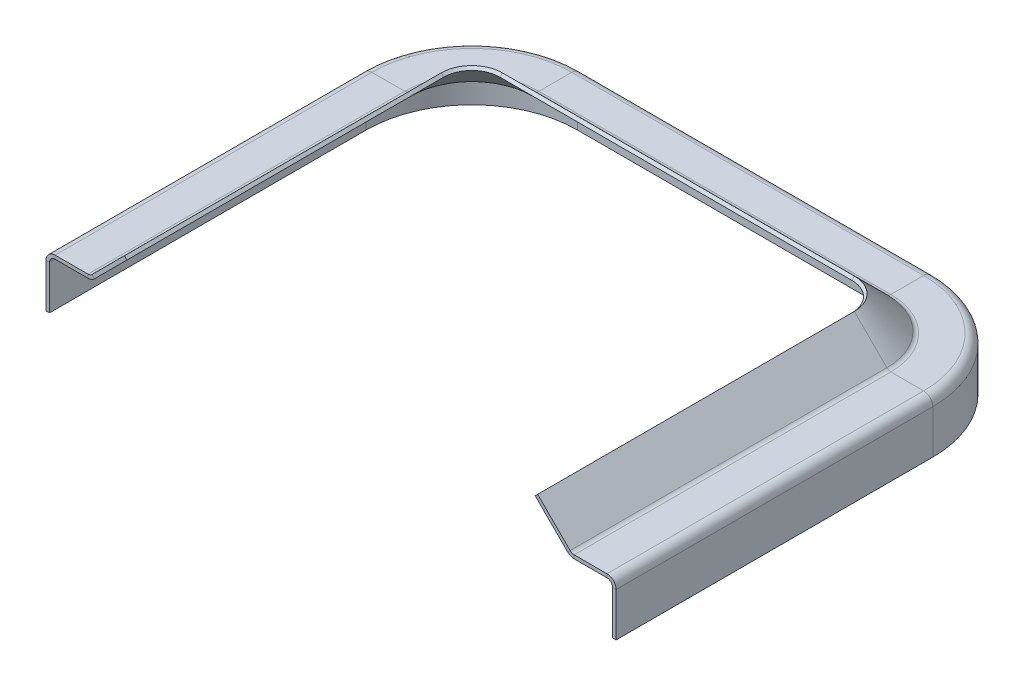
ISO-10303-21;
HEADER;
FILE_DESCRIPTION(('STEP AP214'),'2;1');
FILE_NAME('part.step','',(''),(''),'','','');
FILE_SCHEMA(('AUTOMOTIVE_DESIGN { 1 0 10303 214 1 1 1 1 }'));
ENDSEC;
DATA;
#1=APPLICATION_CONTEXT('core data for automotive mechanical design processes');
#2=APPLICATION_PROTOCOL_DEFINITION('international standard','automotive_design',2000,#1);
#3=PRODUCT_CONTEXT('',#1,'mechanical');
#4=PRODUCT('Part','Part','',(#3));
#5=PRODUCT_RELATED_PRODUCT_CATEGORY('part','',(#4));
#6=PRODUCT_DEFINITION_FORMATION('','',#4);
#7=PRODUCT_DEFINITION_CONTEXT('part definition',#1,'design');
#8=PRODUCT_DEFINITION('design','',#6,#7);
#9=PRODUCT_DEFINITION_SHAPE('','',#8);
#10=(LENGTH_UNIT() NAMED_UNIT(*) SI_UNIT(.MILLI.,.METRE.));
#11=(NAMED_UNIT(*) PLANE_ANGLE_UNIT() SI_UNIT($,.RADIAN.));
#12=(NAMED_UNIT(*) SI_UNIT($,.STERADIAN.) SOLID_ANGLE_UNIT());
#13=UNCERTAINTY_MEASURE_WITH_UNIT(LENGTH_MEASURE(1.E-05),#10,'distance_accuracy_value','');
#14=(GEOMETRIC_REPRESENTATION_CONTEXT(3) GLOBAL_UNCERTAINTY_ASSIGNED_CONTEXT((#13)) GLOBAL_UNIT_ASSIGNED_CONTEXT((#10,
#11,#12)) REPRESENTATION_CONTEXT('',''));
#15=CARTESIAN_POINT('',(0.,0.,0.));
#16=DIRECTION('',(0.,0.,1.));
#17=DIRECTION('',(1.,0.,0.));
#18=AXIS2_PLACEMENT_3D('',#15,#16,#17);
#19=CARTESIAN_POINT('',(372.692388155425,41.5,0.));
#20=DIRECTION('',(0.,0.,-1.));
#21=DIRECTION('',(-1.,0.,0.));
#22=AXIS2_PLACEMENT_3D('',#19,#20,#21);
#23=PLANE('',#22);
#24=DIRECTION('',(0.707106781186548,0.707106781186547,0.));
#25=VECTOR('',#24,1.);
#26=CARTESIAN_POINT('',(368.096194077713,36.9038059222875,0.));
#27=LINE('',#26,#25);
#28=CARTESIAN_POINT('',(368.096194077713,36.9038059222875,0.));
#29=VERTEX_POINT('',#28);
#30=CARTESIAN_POINT('',(369.863961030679,38.6715728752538,0.));
#31=VERTEX_POINT('',#30);
#32=EDGE_CURVE('E11',#29,#31,#27,.T.);
#33=ORIENTED_EDGE('',*,*,#32,.F.);
#34=CARTESIAN_POINT('',(372.692388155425,41.5,0.));
#35=DIRECTION('',(0.,0.,1.));
#36=DIRECTION('',(1.,0.,0.));
#37=AXIS2_PLACEMENT_3D('',#34,#35,#36);
#38=CIRCLE('',#37,6.5);
#39=CARTESIAN_POINT('',(372.692388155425,35.,0.));
#40=VERTEX_POINT('',#39);
#41=EDGE_CURVE('E263',#40,#29,#38,.F.);
#42=ORIENTED_EDGE('',*,*,#41,.F.);
#43=DIRECTION('',(0.,1.,0.));
#44=VECTOR('',#43,1.);
#45=CARTESIAN_POINT('',(372.692388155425,35.,0.));
#46=LINE('',#45,#44);
#47=CARTESIAN_POINT('',(372.692388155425,37.5,0.));
#48=VERTEX_POINT('',#47);
#49=EDGE_CURVE('E46',#40,#48,#46,.T.);
#50=ORIENTED_EDGE('',*,*,#49,.T.);
#51=CARTESIAN_POINT('',(372.692388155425,41.5,0.));
#52=DIRECTION('',(0.,0.,1.));
#53=DIRECTION('',(1.,0.,0.));
#54=AXIS2_PLACEMENT_3D('',#51,#52,#53);
#55=CIRCLE('',#54,4.);
#56=EDGE_CURVE('E260',#48,#31,#55,.F.);
#57=ORIENTED_EDGE('',*,*,#56,.T.);
#58=EDGE_LOOP('',(#33,#42,#50,#57));
#59=FACE_BOUND('',#58,.T.);
#60=ADVANCED_FACE('F36',(#59),#23,.F.);
#61=CARTESIAN_POINT('',(400.,35.,0.));
#62=DIRECTION('',(0.,0.,-1.));
#63=DIRECTION('',(-1.,0.,0.));
#64=AXIS2_PLACEMENT_3D('',#61,#62,#63);
#65=PLANE('',#64);
#66=ORIENTED_EDGE('',*,*,#49,.F.);
#67=DIRECTION('',(-1.,0.,0.));
#68=VECTOR('',#67,1.);
#69=CARTESIAN_POINT('',(400.,35.,0.));
#70=LINE('',#69,#68);
#71=CARTESIAN_POINT('',(396.,35.,0.));
#72=VERTEX_POINT('',#71);
#73=EDGE_CURVE('E530',#72,#40,#70,.T.);
#74=ORIENTED_EDGE('',*,*,#73,.F.);
#75=DIRECTION('',(0.,1.,0.));
#76=VECTOR('',#75,1.);
#77=CARTESIAN_POINT('',(396.,35.,0.));
#78=LINE('',#77,#76);
#79=CARTESIAN_POINT('',(396.,37.5,0.));
#80=VERTEX_POINT('',#79);
#81=EDGE_CURVE('E252',#72,#80,#78,.T.);
#82=ORIENTED_EDGE('',*,*,#81,.T.);
#83=DIRECTION('',(1.,0.,0.));
#84=VECTOR('',#83,1.);
#85=CARTESIAN_POINT('',(400.,37.5,0.));
#86=LINE('',#85,#84);
#87=EDGE_CURVE('E281',#80,#48,#86,.F.);
#88=ORIENTED_EDGE('',*,*,#87,.T.);
#89=EDGE_LOOP('',(#66,#74,#82,#88));
#90=FACE_BOUND('',#89,.T.);
#91=ADVANCED_FACE('F282',(#90),#65,.F.);
#92=CARTESIAN_POINT('',(396.,31.,0.));
#93=DIRECTION('',(0.,0.,1.));
#94=DIRECTION('',(1.,0.,0.));
#95=AXIS2_PLACEMENT_3D('',#92,#93,#94);
#96=PLANE('',#95);
#97=ORIENTED_EDGE('',*,*,#81,.F.);
#98=CARTESIAN_POINT('',(396.,31.,0.));
#99=DIRECTION('',(0.,0.,-1.));
#100=DIRECTION('',(-1.,0.,0.));
#101=AXIS2_PLACEMENT_3D('',#98,#99,#100);
#102=CIRCLE('',#101,4.);
#103=CARTESIAN_POINT('',(400.,31.,0.));
#104=VERTEX_POINT('',#103);
#105=EDGE_CURVE('E499',#104,#72,#102,.F.);
#106=ORIENTED_EDGE('',*,*,#105,.F.);
#107=DIRECTION('',(1.,0.,0.));
#108=VECTOR('',#107,1.);
#109=CARTESIAN_POINT('',(400.,31.,0.));
#110=LINE('',#109,#108);
#111=CARTESIAN_POINT('',(402.5,31.,0.));
#112=VERTEX_POINT('',#111);
#113=EDGE_CURVE('E249',#104,#112,#110,.T.);
#114=ORIENTED_EDGE('',*,*,#113,.T.);
#115=CARTESIAN_POINT('',(396.,31.,0.));
#116=DIRECTION('',(0.,0.,1.));
#117=DIRECTION('',(1.,0.,0.));
#118=AXIS2_PLACEMENT_3D('',#115,#116,#117);
#119=CIRCLE('',#118,6.5);
#120=EDGE_CURVE('E303',#112,#80,#119,.T.);
#121=ORIENTED_EDGE('',*,*,#120,.T.);
#122=EDGE_LOOP('',(#97,#106,#114,#121));
#123=FACE_BOUND('',#122,.T.);
#124=ADVANCED_FACE('F677',(#123),#96,.T.);
#125=CARTESIAN_POINT('',(400.,0.,0.));
#126=DIRECTION('',(0.,0.,-1.));
#127=DIRECTION('',(0.,1.,0.));
#128=AXIS2_PLACEMENT_3D('',#125,#126,#127);
#129=PLANE('',#128);
#130=ORIENTED_EDGE('',*,*,#113,.F.);
#131=DIRECTION('',(0.,1.,0.));
#132=VECTOR('',#131,1.);
#133=CARTESIAN_POINT('',(400.,0.,0.));
#134=LINE('',#133,#132);
#135=CARTESIAN_POINT('',(400.,0.,0.));
#136=VERTEX_POINT('',#135);
#137=EDGE_CURVE('E493',#136,#104,#134,.T.);
#138=ORIENTED_EDGE('',*,*,#137,.F.);
#139=DIRECTION('',(1.,0.,0.));
#140=VECTOR('',#139,1.);
#141=CARTESIAN_POINT('',(400.,0.,0.));
#142=LINE('',#141,#140);
#143=CARTESIAN_POINT('',(402.5,0.,0.));
#144=VERTEX_POINT('',#143);
#145=EDGE_CURVE('E246',#136,#144,#142,.T.);
#146=ORIENTED_EDGE('',*,*,#145,.T.);
#147=DIRECTION('',(0.,1.,0.));
#148=VECTOR('',#147,1.);
#149=CARTESIAN_POINT('',(402.5,0.,0.));
#150=LINE('',#149,#148);
#151=EDGE_CURVE('E309',#144,#112,#150,.T.);
#152=ORIENTED_EDGE('',*,*,#151,.T.);
#153=EDGE_LOOP('',(#130,#138,#146,#152));
#154=FACE_BOUND('',#153,.T.);
#155=ADVANCED_FACE('F685',(#154),#129,.F.);
#156=CARTESIAN_POINT('',(400.,0.,-225.));
#157=DIRECTION('',(0.,1.,0.));
#158=DIRECTION('',(0.,0.,1.));
#159=AXIS2_PLACEMENT_3D('',#156,#157,#158);
#160=PLANE('',#159);
#161=ORIENTED_EDGE('',*,*,#145,.F.);
#162=DIRECTION('',(0.,0.,1.));
#163=VECTOR('',#162,1.);
#164=CARTESIAN_POINT('',(400.,0.,-225.));
#165=LINE('',#164,#163);
#166=CARTESIAN_POINT('',(400.,0.,-225.));
#167=VERTEX_POINT('',#166);
#168=EDGE_CURVE('E195',#167,#136,#165,.T.);
#169=ORIENTED_EDGE('',*,*,#168,.F.);
#170=DIRECTION('',(1.,0.,0.));
#171=VECTOR('',#170,1.);
#172=CARTESIAN_POINT('',(400.,0.,-225.));
#173=LINE('',#172,#171);
#174=CARTESIAN_POINT('',(402.5,0.,-225.));
#175=VERTEX_POINT('',#174);
#176=EDGE_CURVE('E243',#167,#175,#173,.T.);
#177=ORIENTED_EDGE('',*,*,#176,.T.);
#178=DIRECTION('',(0.,0.,-1.));
#179=VECTOR('',#178,1.);
#180=CARTESIAN_POINT('',(402.5,0.,-225.));
#181=LINE('',#180,#179);
#182=EDGE_CURVE('E417',#175,#144,#181,.F.);
#183=ORIENTED_EDGE('',*,*,#182,.T.);
#184=EDGE_LOOP('',(#161,#169,#177,#183));
#185=FACE_BOUND('',#184,.T.);
#186=ADVANCED_FACE('F839',(#185),#160,.F.);
#187=CARTESIAN_POINT('',(325.,0.,-225.));
#188=DIRECTION('',(0.,1.,0.));
#189=DIRECTION('',(0.,0.,1.));
#190=AXIS2_PLACEMENT_3D('',#187,#188,#189);
#191=PLANE('',#190);
#192=ORIENTED_EDGE('',*,*,#176,.F.);
#193=CARTESIAN_POINT('',(325.,0.,-225.));
#194=DIRECTION('',(0.,-1.,0.));
#195=DIRECTION('',(0.,0.,-1.));
#196=AXIS2_PLACEMENT_3D('',#193,#194,#195);
#197=CIRCLE('',#196,75.0000000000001);
#198=CARTESIAN_POINT('',(325.,0.,-300.));
#199=VERTEX_POINT('',#198);
#200=EDGE_CURVE('E487',#199,#167,#197,.T.);
#201=ORIENTED_EDGE('',*,*,#200,.F.);
#202=DIRECTION('',(0.,0.,-1.));
#203=VECTOR('',#202,1.);
#204=CARTESIAN_POINT('',(325.,0.,-300.));
#205=LINE('',#204,#203);
#206=CARTESIAN_POINT('',(325.,0.,-302.5));
#207=VERTEX_POINT('',#206);
#208=EDGE_CURVE('E240',#199,#207,#205,.T.);
#209=ORIENTED_EDGE('',*,*,#208,.T.);
#210=CARTESIAN_POINT('',(325.,0.,-225.));
#211=DIRECTION('',(0.,-1.,0.));
#212=DIRECTION('',(0.,0.,-1.));
#213=AXIS2_PLACEMENT_3D('',#210,#211,#212);
#214=CIRCLE('',#213,77.5000000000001);
#215=EDGE_CURVE('E317',#207,#175,#214,.T.);
#216=ORIENTED_EDGE('',*,*,#215,.T.);
#217=EDGE_LOOP('',(#192,#201,#209,#216));
#218=FACE_BOUND('',#217,.T.);
#219=ADVANCED_FACE('F842',(#218),#191,.F.);
#220=CARTESIAN_POINT('',(75.,0.,-300.));
#221=DIRECTION('',(0.,1.,0.));
#222=DIRECTION('',(1.,0.,0.));
#223=AXIS2_PLACEMENT_3D('',#220,#221,#222);
#224=PLANE('',#223);
#225=ORIENTED_EDGE('',*,*,#208,.F.);
#226=DIRECTION('',(1.,0.,0.));
#227=VECTOR('',#226,1.);
#228=CARTESIAN_POINT('',(75.,0.,-300.));
#229=LINE('',#228,#227);
#230=CARTESIAN_POINT('',(75.,0.,-300.));
#231=VERTEX_POINT('',#230);
#232=EDGE_CURVE('E477',#231,#199,#229,.T.);
#233=ORIENTED_EDGE('',*,*,#232,.F.);
#234=DIRECTION('',(0.,0.,-1.));
#235=VECTOR('',#234,1.);
#236=CARTESIAN_POINT('',(75.,0.,-300.));
#237=LINE('',#236,#235);
#238=CARTESIAN_POINT('',(75.,0.,-302.5));
#239=VERTEX_POINT('',#238);
#240=EDGE_CURVE('E237',#231,#239,#237,.T.);
#241=ORIENTED_EDGE('',*,*,#240,.T.);
#242=DIRECTION('',(-1.,0.,0.));
#243=VECTOR('',#242,1.);
#244=CARTESIAN_POINT('',(75.,0.,-302.5));
#245=LINE('',#244,#243);
#246=EDGE_CURVE('E371',#239,#207,#245,.F.);
#247=ORIENTED_EDGE('',*,*,#246,.T.);
#248=EDGE_LOOP('',(#225,#233,#241,#247));
#249=FACE_BOUND('',#248,.T.);
#250=ADVANCED_FACE('F846',(#249),#224,.F.);
#251=CARTESIAN_POINT('',(75.,0.,-225.));
#252=DIRECTION('',(0.,1.,0.));
#253=DIRECTION('',(0.,0.,1.));
#254=AXIS2_PLACEMENT_3D('',#251,#252,#253);
#255=PLANE('',#254);
#256=ORIENTED_EDGE('',*,*,#240,.F.);
#257=CARTESIAN_POINT('',(75.,0.,-225.));
#258=DIRECTION('',(0.,-1.,0.));
#259=DIRECTION('',(-1.,0.,0.));
#260=AXIS2_PLACEMENT_3D('',#257,#258,#259);
#261=CIRCLE('',#260,75.);
#262=CARTESIAN_POINT('',(0.,0.,-225.));
#263=VERTEX_POINT('',#262);
#264=EDGE_CURVE('E467',#263,#231,#261,.T.);
#265=ORIENTED_EDGE('',*,*,#264,.F.);
#266=DIRECTION('',(-1.,0.,0.));
#267=VECTOR('',#266,1.);
#268=CARTESIAN_POINT('',(0.,0.,-225.));
#269=LINE('',#268,#267);
#270=CARTESIAN_POINT('',(-2.50000000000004,0.,-225.));
#271=VERTEX_POINT('',#270);
#272=EDGE_CURVE('E234',#263,#271,#269,.T.);
#273=ORIENTED_EDGE('',*,*,#272,.T.);
#274=CARTESIAN_POINT('',(75.,0.,-225.));
#275=DIRECTION('',(0.,-1.,0.));
#276=DIRECTION('',(0.,0.,-1.));
#277=AXIS2_PLACEMENT_3D('',#274,#275,#276);
#278=CIRCLE('',#277,77.5);
#279=EDGE_CURVE('E375',#271,#239,#278,.T.);
#280=ORIENTED_EDGE('',*,*,#279,.T.);
#281=EDGE_LOOP('',(#256,#265,#273,#280));
#282=FACE_BOUND('',#281,.T.);
#283=ADVANCED_FACE('F862',(#282),#255,.F.);
#284=CARTESIAN_POINT('',(0.,0.,0.));
#285=DIRECTION('',(0.,1.,0.));
#286=DIRECTION('',(0.,0.,-1.));
#287=AXIS2_PLACEMENT_3D('',#284,#285,#286);
#288=PLANE('',#287);
#289=ORIENTED_EDGE('',*,*,#272,.F.);
#290=DIRECTION('',(0.,0.,-1.));
#291=VECTOR('',#290,1.);
#292=CARTESIAN_POINT('',(0.,0.,0.));
#293=LINE('',#292,#291);
#294=CARTESIAN_POINT('',(0.,0.,0.));
#295=VERTEX_POINT('',#294);
#296=EDGE_CURVE('E457',#295,#263,#293,.T.);
#297=ORIENTED_EDGE('',*,*,#296,.F.);
#298=DIRECTION('',(-1.,0.,0.));
#299=VECTOR('',#298,1.);
#300=CARTESIAN_POINT('',(0.,0.,0.));
#301=LINE('',#300,#299);
#302=CARTESIAN_POINT('',(-2.5,0.,0.));
#303=VERTEX_POINT('',#302);
#304=EDGE_CURVE('E231',#295,#303,#301,.T.);
#305=ORIENTED_EDGE('',*,*,#304,.T.);
#306=DIRECTION('',(0.,0.,1.));
#307=VECTOR('',#306,1.);
#308=CARTESIAN_POINT('',(-2.5,0.,0.));
#309=LINE('',#308,#307);
#310=EDGE_CURVE('E412',#303,#271,#309,.F.);
#311=ORIENTED_EDGE('',*,*,#310,.T.);
#312=EDGE_LOOP('',(#289,#297,#305,#311));
#313=FACE_BOUND('',#312,.T.);
#314=ADVANCED_FACE('F863',(#313),#288,.F.);
#315=CARTESIAN_POINT('',(0.,0.,0.));
#316=DIRECTION('',(0.,0.,1.));
#317=DIRECTION('',(0.,1.,0.));
#318=AXIS2_PLACEMENT_3D('',#315,#316,#317);
#319=PLANE('',#318);
#320=ORIENTED_EDGE('',*,*,#304,.F.);
#321=DIRECTION('',(0.,1.,0.));
#322=VECTOR('',#321,1.);
#323=CARTESIAN_POINT('',(0.,0.,0.));
#324=LINE('',#323,#322);
#325=CARTESIAN_POINT('',(0.,31.,0.));
#326=VERTEX_POINT('',#325);
#327=EDGE_CURVE('E449',#295,#326,#324,.T.);
#328=ORIENTED_EDGE('',*,*,#327,.T.);
#329=DIRECTION('',(-1.,0.,0.));
#330=VECTOR('',#329,1.);
#331=CARTESIAN_POINT('',(0.,31.,0.));
#332=LINE('',#331,#330);
#333=CARTESIAN_POINT('',(-2.5,31.,0.));
#334=VERTEX_POINT('',#333);
#335=EDGE_CURVE('E228',#326,#334,#332,.T.);
#336=ORIENTED_EDGE('',*,*,#335,.T.);
#337=DIRECTION('',(0.,1.,0.));
#338=VECTOR('',#337,1.);
#339=CARTESIAN_POINT('',(-2.5,0.,0.));
#340=LINE('',#339,#338);
#341=EDGE_CURVE('E201',#303,#334,#340,.T.);
#342=ORIENTED_EDGE('',*,*,#341,.F.);
#343=EDGE_LOOP('',(#320,#328,#336,#342));
#344=FACE_BOUND('',#343,.T.);
#345=ADVANCED_FACE('F868',(#344),#319,.T.);
#346=CARTESIAN_POINT('',(4.,31.,0.));
#347=DIRECTION('',(0.,0.,-1.));
#348=DIRECTION('',(-1.,0.,0.));
#349=AXIS2_PLACEMENT_3D('',#346,#347,#348);
#350=PLANE('',#349);
#351=ORIENTED_EDGE('',*,*,#335,.F.);
#352=CARTESIAN_POINT('',(4.,31.,0.));
#353=DIRECTION('',(0.,0.,1.));
#354=DIRECTION('',(1.,0.,0.));
#355=AXIS2_PLACEMENT_3D('',#352,#353,#354);
#356=CIRCLE('',#355,4.);
#357=CARTESIAN_POINT('',(4.,35.,0.));
#358=VERTEX_POINT('',#357);
#359=EDGE_CURVE('E452',#326,#358,#356,.F.);
#360=ORIENTED_EDGE('',*,*,#359,.T.);
#361=DIRECTION('',(0.,1.,0.));
#362=VECTOR('',#361,1.);
#363=CARTESIAN_POINT('',(4.,35.,0.));
#364=LINE('',#363,#362);
#365=CARTESIAN_POINT('',(4.,37.5,0.));
#366=VERTEX_POINT('',#365);
#367=EDGE_CURVE('E225',#358,#366,#364,.T.);
#368=ORIENTED_EDGE('',*,*,#367,.T.);
#369=CARTESIAN_POINT('',(4.,31.,0.));
#370=DIRECTION('',(0.,0.,-1.));
#371=DIRECTION('',(-1.,0.,0.));
#372=AXIS2_PLACEMENT_3D('',#369,#370,#371);
#373=CIRCLE('',#372,6.5);
#374=EDGE_CURVE('E204',#334,#366,#373,.T.);
#375=ORIENTED_EDGE('',*,*,#374,.F.);
#376=EDGE_LOOP('',(#351,#360,#368,#375));
#377=FACE_BOUND('',#376,.T.);
#378=ADVANCED_FACE('F733',(#377),#350,.F.);
#379=CARTESIAN_POINT('',(0.,35.,0.));
#380=DIRECTION('',(0.,0.,1.));
#381=DIRECTION('',(1.,0.,0.));
#382=AXIS2_PLACEMENT_3D('',#379,#380,#381);
#383=PLANE('',#382);
#384=ORIENTED_EDGE('',*,*,#367,.F.);
#385=DIRECTION('',(1.,0.,0.));
#386=VECTOR('',#385,1.);
#387=CARTESIAN_POINT('',(0.,35.,0.));
#388=LINE('',#387,#386);
#389=CARTESIAN_POINT('',(27.3076118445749,35.,0.));
#390=VERTEX_POINT('',#389);
#391=EDGE_CURVE('E504',#358,#390,#388,.T.);
#392=ORIENTED_EDGE('',*,*,#391,.T.);
#393=DIRECTION('',(0.,1.,0.));
#394=VECTOR('',#393,1.);
#395=CARTESIAN_POINT('',(27.3076118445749,35.,0.));
#396=LINE('',#395,#394);
#397=CARTESIAN_POINT('',(27.3076118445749,37.5,0.));
#398=VERTEX_POINT('',#397);
#399=EDGE_CURVE('E222',#390,#398,#396,.T.);
#400=ORIENTED_EDGE('',*,*,#399,.T.);
#401=DIRECTION('',(1.,0.,0.));
#402=VECTOR('',#401,1.);
#403=CARTESIAN_POINT('',(0.,37.5,0.));
#404=LINE('',#403,#402);
#405=EDGE_CURVE('E430',#366,#398,#404,.T.);
#406=ORIENTED_EDGE('',*,*,#405,.F.);
#407=EDGE_LOOP('',(#384,#392,#400,#406));
#408=FACE_BOUND('',#407,.T.);
#409=ADVANCED_FACE('F738',(#408),#383,.T.);
#410=CARTESIAN_POINT('',(27.3076118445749,41.5,0.));
#411=DIRECTION('',(0.,0.,1.));
#412=DIRECTION('',(1.,0.,0.));
#413=AXIS2_PLACEMENT_3D('',#410,#411,#412);
#414=PLANE('',#413);
#415=ORIENTED_EDGE('',*,*,#399,.F.);
#416=CARTESIAN_POINT('',(27.3076118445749,41.5,0.));
#417=DIRECTION('',(0.,0.,-1.));
#418=DIRECTION('',(-1.,0.,0.));
#419=AXIS2_PLACEMENT_3D('',#416,#417,#418);
#420=CIRCLE('',#419,6.5);
#421=CARTESIAN_POINT('',(31.9038059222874,36.9038059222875,0.));
#422=VERTEX_POINT('',#421);
#423=EDGE_CURVE('E533',#390,#422,#420,.F.);
#424=ORIENTED_EDGE('',*,*,#423,.T.);
#425=DIRECTION('',(-0.707106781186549,0.707106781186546,0.));
#426=VECTOR('',#425,1.);
#427=CARTESIAN_POINT('',(31.9038059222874,36.9038059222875,0.));
#428=LINE('',#427,#426);
#429=CARTESIAN_POINT('',(30.1360389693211,38.6715728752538,0.));
#430=VERTEX_POINT('',#429);
#431=EDGE_CURVE('E219',#422,#430,#428,.T.);
#432=ORIENTED_EDGE('',*,*,#431,.T.);
#433=CARTESIAN_POINT('',(27.3076118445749,41.5,0.));
#434=DIRECTION('',(0.,0.,-1.));
#435=DIRECTION('',(-1.,0.,0.));
#436=AXIS2_PLACEMENT_3D('',#433,#434,#435);
#437=CIRCLE('',#436,4.);
#438=EDGE_CURVE('E427',#398,#430,#437,.F.);
#439=ORIENTED_EDGE('',*,*,#438,.F.);
#440=EDGE_LOOP('',(#415,#424,#432,#439));
#441=FACE_BOUND('',#440,.T.);
#442=ADVANCED_FACE('F810',(#441),#414,.T.);
#443=CARTESIAN_POINT('',(30.,35.,0.));
#444=DIRECTION('',(0.,0.,1.));
#445=DIRECTION('',(0.707106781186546,0.707106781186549,0.));
#446=AXIS2_PLACEMENT_3D('',#443,#444,#445);
#447=PLANE('',#446);
#448=ORIENTED_EDGE('',*,*,#431,.F.);
#449=DIRECTION('',(0.707106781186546,0.707106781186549,0.));
#450=VECTOR('',#449,1.);
#451=CARTESIAN_POINT('',(30.,35.,0.));
#452=LINE('',#451,#450);
#453=CARTESIAN_POINT('',(54.9999999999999,60.,0.));
#454=VERTEX_POINT('',#453);
#455=EDGE_CURVE('E462',#422,#454,#452,.T.);
#456=ORIENTED_EDGE('',*,*,#455,.T.);
#457=DIRECTION('',(-0.707106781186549,0.707106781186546,0.));
#458=VECTOR('',#457,1.);
#459=CARTESIAN_POINT('',(54.9999999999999,60.,0.));
#460=LINE('',#459,#458);
#461=CARTESIAN_POINT('',(53.2322330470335,61.7677669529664,0.));
#462=VERTEX_POINT('',#461);
#463=EDGE_CURVE('E216',#454,#462,#460,.T.);
#464=ORIENTED_EDGE('',*,*,#463,.T.);
#465=DIRECTION('',(-0.707106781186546,-0.707106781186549,0.));
#466=VECTOR('',#465,1.);
#467=CARTESIAN_POINT('',(28.2322330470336,36.7677669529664,0.));
#468=LINE('',#467,#466);
#469=EDGE_CURVE('E424',#430,#462,#468,.F.);
#470=ORIENTED_EDGE('',*,*,#469,.F.);
#471=EDGE_LOOP('',(#448,#456,#464,#470));
#472=FACE_BOUND('',#471,.T.);
#473=ADVANCED_FACE('F615',(#472),#447,.T.);
#474=CARTESIAN_POINT('',(54.9999999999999,60.,0.));
#475=DIRECTION('',(0.707106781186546,0.707106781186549,0.));
#476=DIRECTION('',(0.,0.,-1.));
#477=AXIS2_PLACEMENT_3D('',#474,#475,#476);
#478=PLANE('',#477);
#479=ORIENTED_EDGE('',*,*,#463,.F.);
#480=DIRECTION('',(0.,0.,-1.));
#481=VECTOR('',#480,1.);
#482=CARTESIAN_POINT('',(54.9999999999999,60.,0.));
#483=LINE('',#482,#481);
#484=CARTESIAN_POINT('',(54.9999999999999,60.,-225.));
#485=VERTEX_POINT('',#484);
#486=EDGE_CURVE('E472',#454,#485,#483,.T.);
#487=ORIENTED_EDGE('',*,*,#486,.T.);
#488=DIRECTION('',(-0.707106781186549,0.707106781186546,0.));
#489=VECTOR('',#488,1.);
#490=CARTESIAN_POINT('',(54.9999999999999,60.,-225.));
#491=LINE('',#490,#489);
#492=CARTESIAN_POINT('',(53.2322330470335,61.7677669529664,-225.));
#493=VERTEX_POINT('',#492);
#494=EDGE_CURVE('E213',#485,#493,#491,.T.);
#495=ORIENTED_EDGE('',*,*,#494,.T.);
#496=DIRECTION('',(0.,0.,1.));
#497=VECTOR('',#496,1.);
#498=CARTESIAN_POINT('',(53.2322330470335,61.7677669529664,0.));
#499=LINE('',#498,#497);
#500=EDGE_CURVE('E400',#462,#493,#499,.F.);
#501=ORIENTED_EDGE('',*,*,#500,.F.);
#502=EDGE_LOOP('',(#479,#487,#495,#501));
#503=FACE_BOUND('',#502,.T.);
#504=ADVANCED_FACE('F608',(#503),#478,.T.);
#505=CARTESIAN_POINT('',(75.,60.,-225.));
#506=DIRECTION('',(0.,1.,0.));
#507=DIRECTION('',(0.,0.,1.));
#508=AXIS2_PLACEMENT_3D('',#505,#506,#507);
#509=CONICAL_SURFACE('',#508,20.0000000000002,0.785398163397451);
#510=ORIENTED_EDGE('',*,*,#494,.F.);
#511=CARTESIAN_POINT('',(75.,60.,-225.));
#512=DIRECTION('',(0.,-1.,0.));
#513=DIRECTION('',(-1.,0.,0.));
#514=AXIS2_PLACEMENT_3D('',#511,#512,#513);
#515=CIRCLE('',#514,20.0000000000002);
#516=CARTESIAN_POINT('',(75.,60.,-245.));
#517=VERTEX_POINT('',#516);
#518=EDGE_CURVE('E482',#485,#517,#515,.T.);
#519=ORIENTED_EDGE('',*,*,#518,.T.);
#520=DIRECTION('',(0.,0.707106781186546,-0.707106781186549));
#521=VECTOR('',#520,1.);
#522=CARTESIAN_POINT('',(75.,60.,-245.));
#523=LINE('',#522,#521);
#524=CARTESIAN_POINT('',(75.,61.7677669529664,-246.767766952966));
#525=VERTEX_POINT('',#524);
#526=EDGE_CURVE('E210',#517,#525,#523,.T.);
#527=ORIENTED_EDGE('',*,*,#526,.T.);
#528=CARTESIAN_POINT('',(75.,61.7677669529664,-225.));
#529=DIRECTION('',(0.,-1.,0.));
#530=DIRECTION('',(0.,0.,-1.));
#531=AXIS2_PLACEMENT_3D('',#528,#529,#530);
#532=CIRCLE('',#531,21.7677669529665);
#533=EDGE_CURVE('E348',#493,#525,#532,.T.);
#534=ORIENTED_EDGE('',*,*,#533,.F.);
#535=EDGE_LOOP('',(#510,#519,#527,#534));
#536=FACE_BOUND('',#535,.T.);
#537=ADVANCED_FACE('F600',(#536),#509,.F.);
#538=CARTESIAN_POINT('',(75.,60.,-245.));
#539=DIRECTION('',(0.,0.707106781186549,0.707106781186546));
#540=DIRECTION('',(1.,0.,0.));
#541=AXIS2_PLACEMENT_3D('',#538,#539,#540);
#542=PLANE('',#541);
#543=ORIENTED_EDGE('',*,*,#526,.F.);
#544=DIRECTION('',(1.,0.,0.));
#545=VECTOR('',#544,1.);
#546=CARTESIAN_POINT('',(75.,60.,-245.));
#547=LINE('',#546,#545);
#548=CARTESIAN_POINT('',(325.,60.,-245.));
#549=VERTEX_POINT('',#548);
#550=EDGE_CURVE('E492',#517,#549,#547,.T.);
#551=ORIENTED_EDGE('',*,*,#550,.T.);
#552=DIRECTION('',(0.,0.707106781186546,-0.707106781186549));
#553=VECTOR('',#552,1.);
#554=CARTESIAN_POINT('',(325.,60.,-245.));
#555=LINE('',#554,#553);
#556=CARTESIAN_POINT('',(325.,61.7677669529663,-246.767766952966));
#557=VERTEX_POINT('',#556);
#558=EDGE_CURVE('E176',#549,#557,#555,.T.);
#559=ORIENTED_EDGE('',*,*,#558,.T.);
#560=DIRECTION('',(1.,0.,0.));
#561=VECTOR('',#560,1.);
#562=CARTESIAN_POINT('',(75.,61.7677669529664,-246.767766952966));
#563=LINE('',#562,#561);
#564=EDGE_CURVE('E342',#525,#557,#563,.T.);
#565=ORIENTED_EDGE('',*,*,#564,.F.);
#566=EDGE_LOOP('',(#543,#551,#559,#565));
#567=FACE_BOUND('',#566,.T.);
#568=ADVANCED_FACE('F592',(#567),#542,.T.);
#569=CARTESIAN_POINT('',(325.,60.,-225.));
#570=DIRECTION('',(0.,1.,0.));
#571=DIRECTION('',(0.,0.,1.));
#572=AXIS2_PLACEMENT_3D('',#569,#570,#571);
#573=CONICAL_SURFACE('',#572,20.0000000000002,0.785398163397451);
#574=ORIENTED_EDGE('',*,*,#558,.F.);
#575=CARTESIAN_POINT('',(325.,60.,-225.));
#576=DIRECTION('',(0.,-1.,0.));
#577=DIRECTION('',(0.,0.,-1.));
#578=AXIS2_PLACEMENT_3D('',#575,#576,#577);
#579=CIRCLE('',#578,20.0000000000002);
#580=CARTESIAN_POINT('',(345.,60.,-225.));
#581=VERTEX_POINT('',#580);
#582=EDGE_CURVE('E184',#549,#581,#579,.T.);
#583=ORIENTED_EDGE('',*,*,#582,.T.);
#584=DIRECTION('',(0.707106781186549,0.707106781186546,0.));
#585=VECTOR('',#584,1.);
#586=CARTESIAN_POINT('',(345.,60.,-225.));
#587=LINE('',#586,#585);
#588=CARTESIAN_POINT('',(346.767766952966,61.7677669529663,-225.));
#589=VERTEX_POINT('',#588);
#590=EDGE_CURVE('E163',#581,#589,#587,.T.);
#591=ORIENTED_EDGE('',*,*,#590,.T.);
#592=CARTESIAN_POINT('',(325.,61.7677669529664,-225.));
#593=DIRECTION('',(0.,-1.,0.));
#594=DIRECTION('',(0.,0.,-1.));
#595=AXIS2_PLACEMENT_3D('',#592,#593,#594);
#596=CIRCLE('',#595,21.7677669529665);
#597=EDGE_CURVE('E415',#557,#589,#596,.T.);
#598=ORIENTED_EDGE('',*,*,#597,.F.);
#599=EDGE_LOOP('',(#574,#583,#591,#598));
#600=FACE_BOUND('',#599,.T.);
#601=ADVANCED_FACE('F192',(#600),#573,.F.);
#602=CARTESIAN_POINT('',(345.,60.,-225.));
#603=DIRECTION('',(-0.707106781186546,0.707106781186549,0.));
#604=DIRECTION('',(0.,0.,1.));
#605=AXIS2_PLACEMENT_3D('',#602,#603,#604);
#606=PLANE('',#605);
#607=ORIENTED_EDGE('',*,*,#590,.F.);
#608=DIRECTION('',(0.,0.,1.));
#609=VECTOR('',#608,1.);
#610=CARTESIAN_POINT('',(345.,60.,-225.));
#611=LINE('',#610,#609);
#612=CARTESIAN_POINT('',(345.,60.,0.));
#613=VERTEX_POINT('',#612);
#614=EDGE_CURVE('E167',#581,#613,#611,.T.);
#615=ORIENTED_EDGE('',*,*,#614,.T.);
#616=DIRECTION('',(0.707106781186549,0.707106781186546,0.));
#617=VECTOR('',#616,1.);
#618=CARTESIAN_POINT('',(345.,60.,0.));
#619=LINE('',#618,#617);
#620=CARTESIAN_POINT('',(346.767766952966,61.7677669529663,0.));
#621=VERTEX_POINT('',#620);
#622=EDGE_CURVE('E40',#613,#621,#619,.T.);
#623=ORIENTED_EDGE('',*,*,#622,.T.);
#624=DIRECTION('',(0.,0.,1.));
#625=VECTOR('',#624,1.);
#626=CARTESIAN_POINT('',(346.767766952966,61.7677669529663,-225.));
#627=LINE('',#626,#625);
#628=EDGE_CURVE('E170',#589,#621,#627,.T.);
#629=ORIENTED_EDGE('',*,*,#628,.F.);
#630=EDGE_LOOP('',(#607,#615,#623,#629));
#631=FACE_BOUND('',#630,.T.);
#632=ADVANCED_FACE('F165',(#631),#606,.T.);
#633=CARTESIAN_POINT('',(370.,35.,0.));
#634=DIRECTION('',(0.,0.,-1.));
#635=DIRECTION('',(-0.707106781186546,0.707106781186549,0.));
#636=AXIS2_PLACEMENT_3D('',#633,#634,#635);
#637=PLANE('',#636);
#638=DIRECTION('',(-0.707106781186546,0.707106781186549,0.));
#639=VECTOR('',#638,1.);
#640=CARTESIAN_POINT('',(370.,35.,0.));
#641=LINE('',#640,#639);
#642=EDGE_CURVE('E200',#29,#613,#641,.T.);
#643=ORIENTED_EDGE('',*,*,#642,.F.);
#644=ORIENTED_EDGE('',*,*,#32,.T.);
#645=DIRECTION('',(-0.707106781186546,0.707106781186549,0.));
#646=VECTOR('',#645,1.);
#647=CARTESIAN_POINT('',(371.767766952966,36.7677669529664,0.));
#648=LINE('',#647,#646);
#649=EDGE_CURVE('E414',#31,#621,#648,.T.);
#650=ORIENTED_EDGE('',*,*,#649,.T.);
#651=ORIENTED_EDGE('',*,*,#622,.F.);
#652=EDGE_LOOP('',(#643,#644,#650,#651));
#653=FACE_BOUND('',#652,.T.);
#654=ADVANCED_FACE('F38',(#653),#637,.F.);
#655=CARTESIAN_POINT('',(371.767766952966,36.7677669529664,-225.));
#656=DIRECTION('',(0.707106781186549,0.707106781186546,0.));
#657=DIRECTION('',(-0.707106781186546,0.707106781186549,0.));
#658=AXIS2_PLACEMENT_3D('',#655,#656,#657);
#659=PLANE('',#658);
#660=ORIENTED_EDGE('',*,*,#628,.T.);
#661=ORIENTED_EDGE('',*,*,#649,.F.);
#662=DIRECTION('',(0.,0.,1.));
#663=VECTOR('',#662,1.);
#664=CARTESIAN_POINT('',(369.863961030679,38.6715728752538,-225.));
#665=LINE('',#664,#663);
#666=CARTESIAN_POINT('',(369.863961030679,38.6715728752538,-225.));
#667=VERTEX_POINT('',#666);
#668=EDGE_CURVE('E278',#667,#31,#665,.T.);
#669=ORIENTED_EDGE('',*,*,#668,.F.);
#670=DIRECTION('',(-0.707106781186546,0.707106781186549,0.));
#671=VECTOR('',#670,1.);
#672=CARTESIAN_POINT('',(371.767766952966,36.7677669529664,-225.));
#673=LINE('',#672,#671);
#674=EDGE_CURVE('E295',#667,#589,#673,.T.);
#675=ORIENTED_EDGE('',*,*,#674,.T.);
#676=EDGE_LOOP('',(#660,#661,#669,#675));
#677=FACE_BOUND('',#676,.T.);
#678=ADVANCED_FACE('F796',(#677),#659,.T.);
#679=CARTESIAN_POINT('',(372.692388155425,41.5,-225.));
#680=DIRECTION('',(0.,0.,1.));
#681=DIRECTION('',(1.,0.,0.));
#682=AXIS2_PLACEMENT_3D('',#679,#680,#681);
#683=CYLINDRICAL_SURFACE('',#682,4.);
#684=ORIENTED_EDGE('',*,*,#668,.T.);
#685=ORIENTED_EDGE('',*,*,#56,.F.);
#686=DIRECTION('',(0.,0.,1.));
#687=VECTOR('',#686,1.);
#688=CARTESIAN_POINT('',(372.692388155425,37.5,-225.));
#689=LINE('',#688,#687);
#690=CARTESIAN_POINT('',(372.692388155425,37.5,-225.));
#691=VERTEX_POINT('',#690);
#692=EDGE_CURVE('E275',#691,#48,#689,.T.);
#693=ORIENTED_EDGE('',*,*,#692,.F.);
#694=CARTESIAN_POINT('',(372.692388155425,41.5,-225.));
#695=DIRECTION('',(0.,0.,1.));
#696=DIRECTION('',(1.,0.,0.));
#697=AXIS2_PLACEMENT_3D('',#694,#695,#696);
#698=CIRCLE('',#697,4.);
#699=EDGE_CURVE('E297',#691,#667,#698,.F.);
#700=ORIENTED_EDGE('',*,*,#699,.T.);
#701=EDGE_LOOP('',(#684,#685,#693,#700));
#702=FACE_BOUND('',#701,.T.);
#703=ADVANCED_FACE('F271',(#702),#683,.F.);
#704=CARTESIAN_POINT('',(400.,37.5,-225.));
#705=DIRECTION('',(0.,1.,0.));
#706=DIRECTION('',(0.,0.,1.));
#707=AXIS2_PLACEMENT_3D('',#704,#705,#706);
#708=PLANE('',#707);
#709=ORIENTED_EDGE('',*,*,#692,.T.);
#710=ORIENTED_EDGE('',*,*,#87,.F.);
#711=DIRECTION('',(0.,0.,1.));
#712=VECTOR('',#711,1.);
#713=CARTESIAN_POINT('',(396.,37.5,-225.));
#714=LINE('',#713,#712);
#715=CARTESIAN_POINT('',(396.,37.5,-225.));
#716=VERTEX_POINT('',#715);
#717=EDGE_CURVE('E286',#716,#80,#714,.T.);
#718=ORIENTED_EDGE('',*,*,#717,.F.);
#719=DIRECTION('',(1.,0.,0.));
#720=VECTOR('',#719,1.);
#721=CARTESIAN_POINT('',(400.,37.5,-225.));
#722=LINE('',#721,#720);
#723=EDGE_CURVE('E291',#716,#691,#722,.F.);
#724=ORIENTED_EDGE('',*,*,#723,.T.);
#725=EDGE_LOOP('',(#709,#710,#718,#724));
#726=FACE_BOUND('',#725,.T.);
#727=ADVANCED_FACE('F289',(#726),#708,.T.);
#728=CARTESIAN_POINT('',(396.,31.,-225.));
#729=DIRECTION('',(0.,0.,1.));
#730=DIRECTION('',(1.,0.,0.));
#731=AXIS2_PLACEMENT_3D('',#728,#729,#730);
#732=CYLINDRICAL_SURFACE('',#731,6.5);
#733=ORIENTED_EDGE('',*,*,#717,.T.);
#734=ORIENTED_EDGE('',*,*,#120,.F.);
#735=DIRECTION('',(0.,0.,-1.));
#736=VECTOR('',#735,1.);
#737=CARTESIAN_POINT('',(402.5,31.,-225.));
#738=LINE('',#737,#736);
#739=CARTESIAN_POINT('',(402.5,31.,-225.));
#740=VERTEX_POINT('',#739);
#741=EDGE_CURVE('E306',#740,#112,#738,.F.);
#742=ORIENTED_EDGE('',*,*,#741,.F.);
#743=CARTESIAN_POINT('',(396.,31.,-225.));
#744=DIRECTION('',(0.,0.,1.));
#745=DIRECTION('',(1.,0.,0.));
#746=AXIS2_PLACEMENT_3D('',#743,#744,#745);
#747=CIRCLE('',#746,6.5);
#748=EDGE_CURVE('E310',#740,#716,#747,.T.);
#749=ORIENTED_EDGE('',*,*,#748,.T.);
#750=EDGE_LOOP('',(#733,#734,#742,#749));
#751=FACE_BOUND('',#750,.T.);
#752=ADVANCED_FACE('F682',(#751),#732,.T.);
#753=CARTESIAN_POINT('',(402.5,0.,-225.));
#754=DIRECTION('',(1.,0.,0.));
#755=DIRECTION('',(0.,0.,-1.));
#756=AXIS2_PLACEMENT_3D('',#753,#754,#755);
#757=PLANE('',#756);
#758=ORIENTED_EDGE('',*,*,#741,.T.);
#759=ORIENTED_EDGE('',*,*,#151,.F.);
#760=ORIENTED_EDGE('',*,*,#182,.F.);
#761=DIRECTION('',(0.,1.,0.));
#762=VECTOR('',#761,1.);
#763=CARTESIAN_POINT('',(402.5,0.,-225.));
#764=LINE('',#763,#762);
#765=EDGE_CURVE('E314',#175,#740,#764,.T.);
#766=ORIENTED_EDGE('',*,*,#765,.T.);
#767=EDGE_LOOP('',(#758,#759,#760,#766));
#768=FACE_BOUND('',#767,.T.);
#769=ADVANCED_FACE('F688',(#768),#757,.T.);
#770=CARTESIAN_POINT('',(325.,38.6715728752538,-225.));
#771=DIRECTION('',(0.,-1.,0.));
#772=DIRECTION('',(0.,0.,-1.));
#773=AXIS2_PLACEMENT_3D('',#770,#771,#772);
#774=CONICAL_SURFACE('',#773,44.863961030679,0.785398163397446);
#775=ORIENTED_EDGE('',*,*,#597,.T.);
#776=ORIENTED_EDGE('',*,*,#674,.F.);
#777=CARTESIAN_POINT('',(325.,38.6715728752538,-225.));
#778=DIRECTION('',(0.,-1.,0.));
#779=DIRECTION('',(0.,0.,-1.));
#780=AXIS2_PLACEMENT_3D('',#777,#778,#779);
#781=CIRCLE('',#780,44.863961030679);
#782=CARTESIAN_POINT('',(325.,38.6715728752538,-269.863961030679));
#783=VERTEX_POINT('',#782);
#784=EDGE_CURVE('E299',#783,#667,#781,.T.);
#785=ORIENTED_EDGE('',*,*,#784,.F.);
#786=DIRECTION('',(0.,-0.707106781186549,-0.707106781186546));
#787=VECTOR('',#786,1.);
#788=CARTESIAN_POINT('',(325.,38.6715728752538,-269.863961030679));
#789=LINE('',#788,#787);
#790=EDGE_CURVE('E339',#783,#557,#789,.F.);
#791=ORIENTED_EDGE('',*,*,#790,.T.);
#792=EDGE_LOOP('',(#775,#776,#785,#791));
#793=FACE_BOUND('',#792,.T.);
#794=ADVANCED_FACE('F798',(#793),#774,.T.);
#795=CARTESIAN_POINT('',(325.,41.5,-225.));
#796=DIRECTION('',(0.,-1.,0.));
#797=DIRECTION('',(0.,0.,-1.));
#798=AXIS2_PLACEMENT_3D('',#795,#796,#797);
#799=TOROIDAL_SURFACE('',#798,47.6923881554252,4.);
#800=ORIENTED_EDGE('',*,*,#784,.T.);
#801=ORIENTED_EDGE('',*,*,#699,.F.);
#802=CARTESIAN_POINT('',(325.,37.5,-225.));
#803=DIRECTION('',(0.,-1.,0.));
#804=DIRECTION('',(0.,0.,-1.));
#805=AXIS2_PLACEMENT_3D('',#802,#803,#804);
#806=CIRCLE('',#805,47.6923881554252);
#807=CARTESIAN_POINT('',(325.,37.5,-272.692388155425));
#808=VERTEX_POINT('',#807);
#809=EDGE_CURVE('E300',#808,#691,#806,.T.);
#810=ORIENTED_EDGE('',*,*,#809,.F.);
#811=CARTESIAN_POINT('',(325.,41.5,-272.692388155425));
#812=DIRECTION('',(-1.,0.,0.));
#813=DIRECTION('',(0.,0.,1.));
#814=AXIS2_PLACEMENT_3D('',#811,#812,#813);
#815=CIRCLE('',#814,4.);
#816=EDGE_CURVE('E335',#808,#783,#815,.T.);
#817=ORIENTED_EDGE('',*,*,#816,.T.);
#818=EDGE_LOOP('',(#800,#801,#810,#817));
#819=FACE_BOUND('',#818,.T.);
#820=ADVANCED_FACE('F799',(#819),#799,.F.);
#821=CARTESIAN_POINT('',(325.,37.5,-300.));
#822=DIRECTION('',(0.,1.,0.));
#823=DIRECTION('',(0.,0.,1.));
#824=AXIS2_PLACEMENT_3D('',#821,#822,#823);
#825=PLANE('',#824);
#826=ORIENTED_EDGE('',*,*,#809,.T.);
#827=ORIENTED_EDGE('',*,*,#723,.F.);
#828=CARTESIAN_POINT('',(325.,37.5,-225.));
#829=DIRECTION('',(0.,-1.,0.));
#830=DIRECTION('',(0.,0.,-1.));
#831=AXIS2_PLACEMENT_3D('',#828,#829,#830);
#832=CIRCLE('',#831,71.0000000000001);
#833=CARTESIAN_POINT('',(325.,37.5,-296.));
#834=VERTEX_POINT('',#833);
#835=EDGE_CURVE('E305',#834,#716,#832,.T.);
#836=ORIENTED_EDGE('',*,*,#835,.F.);
#837=DIRECTION('',(0.,0.,1.));
#838=VECTOR('',#837,1.);
#839=CARTESIAN_POINT('',(325.,37.5,-300.));
#840=LINE('',#839,#838);
#841=EDGE_CURVE('E329',#834,#808,#840,.T.);
#842=ORIENTED_EDGE('',*,*,#841,.T.);
#843=EDGE_LOOP('',(#826,#827,#836,#842));
#844=FACE_BOUND('',#843,.T.);
#845=ADVANCED_FACE('F786',(#844),#825,.T.);
#846=CARTESIAN_POINT('',(325.,31.,-225.));
#847=DIRECTION('',(0.,-1.,0.));
#848=DIRECTION('',(0.,0.,-1.));
#849=AXIS2_PLACEMENT_3D('',#846,#847,#848);
#850=TOROIDAL_SURFACE('',#849,71.0000000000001,6.5);
#851=ORIENTED_EDGE('',*,*,#835,.T.);
#852=ORIENTED_EDGE('',*,*,#748,.F.);
#853=CARTESIAN_POINT('',(325.,31.,-225.));
#854=DIRECTION('',(0.,-1.,0.));
#855=DIRECTION('',(0.,0.,-1.));
#856=AXIS2_PLACEMENT_3D('',#853,#854,#855);
#857=CIRCLE('',#856,77.5000000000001);
#858=CARTESIAN_POINT('',(325.,31.,-302.5));
#859=VERTEX_POINT('',#858);
#860=EDGE_CURVE('E313',#859,#740,#857,.T.);
#861=ORIENTED_EDGE('',*,*,#860,.F.);
#862=CARTESIAN_POINT('',(325.,31.,-296.));
#863=DIRECTION('',(-1.,0.,0.));
#864=DIRECTION('',(0.,0.,1.));
#865=AXIS2_PLACEMENT_3D('',#862,#863,#864);
#866=CIRCLE('',#865,6.5);
#867=EDGE_CURVE('E322',#859,#834,#866,.F.);
#868=ORIENTED_EDGE('',*,*,#867,.T.);
#869=EDGE_LOOP('',(#851,#852,#861,#868));
#870=FACE_BOUND('',#869,.T.);
#871=ADVANCED_FACE('F699',(#870),#850,.T.);
#872=CARTESIAN_POINT('',(325.,0.,-225.));
#873=DIRECTION('',(0.,-1.,0.));
#874=DIRECTION('',(0.,0.,-1.));
#875=AXIS2_PLACEMENT_3D('',#872,#873,#874);
#876=CYLINDRICAL_SURFACE('',#875,77.5000000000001);
#877=ORIENTED_EDGE('',*,*,#860,.T.);
#878=ORIENTED_EDGE('',*,*,#765,.F.);
#879=ORIENTED_EDGE('',*,*,#215,.F.);
#880=DIRECTION('',(0.,-1.,0.));
#881=VECTOR('',#880,1.);
#882=CARTESIAN_POINT('',(325.,0.,-302.5));
#883=LINE('',#882,#881);
#884=EDGE_CURVE('E364',#207,#859,#883,.F.);
#885=ORIENTED_EDGE('',*,*,#884,.T.);
#886=EDGE_LOOP('',(#877,#878,#879,#885));
#887=FACE_BOUND('',#886,.T.);
#888=ADVANCED_FACE('F694',(#887),#876,.T.);
#889=CARTESIAN_POINT('',(75.,36.7677669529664,-271.767766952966));
#890=DIRECTION('',(0.,0.707106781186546,-0.707106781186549));
#891=DIRECTION('',(0.,0.707106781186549,0.707106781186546));
#892=AXIS2_PLACEMENT_3D('',#889,#890,#891);
#893=PLANE('',#892);
#894=ORIENTED_EDGE('',*,*,#564,.T.);
#895=ORIENTED_EDGE('',*,*,#790,.F.);
#896=DIRECTION('',(1.,0.,0.));
#897=VECTOR('',#896,1.);
#898=CARTESIAN_POINT('',(75.,38.6715728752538,-269.863961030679));
#899=LINE('',#898,#897);
#900=CARTESIAN_POINT('',(75.,38.6715728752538,-269.863961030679));
#901=VERTEX_POINT('',#900);
#902=EDGE_CURVE('E338',#901,#783,#899,.T.);
#903=ORIENTED_EDGE('',*,*,#902,.F.);
#904=DIRECTION('',(0.,0.707106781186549,0.707106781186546));
#905=VECTOR('',#904,1.);
#906=CARTESIAN_POINT('',(75.,36.7677669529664,-271.767766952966));
#907=LINE('',#906,#905);
#908=EDGE_CURVE('E345',#901,#525,#907,.T.);
#909=ORIENTED_EDGE('',*,*,#908,.T.);
#910=EDGE_LOOP('',(#894,#895,#903,#909));
#911=FACE_BOUND('',#910,.T.);
#912=ADVANCED_FACE('F1086',(#911),#893,.T.);
#913=CARTESIAN_POINT('',(75.,41.5,-272.692388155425));
#914=DIRECTION('',(1.,0.,0.));
#915=DIRECTION('',(0.,0.,-1.));
#916=AXIS2_PLACEMENT_3D('',#913,#914,#915);
#917=CYLINDRICAL_SURFACE('',#916,4.);
#918=ORIENTED_EDGE('',*,*,#902,.T.);
#919=ORIENTED_EDGE('',*,*,#816,.F.);
#920=DIRECTION('',(1.,0.,0.));
#921=VECTOR('',#920,1.);
#922=CARTESIAN_POINT('',(75.,37.5,-272.692388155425));
#923=LINE('',#922,#921);
#924=CARTESIAN_POINT('',(75.,37.5,-272.692388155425));
#925=VERTEX_POINT('',#924);
#926=EDGE_CURVE('E332',#925,#808,#923,.T.);
#927=ORIENTED_EDGE('',*,*,#926,.F.);
#928=CARTESIAN_POINT('',(75.,41.5,-272.692388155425));
#929=DIRECTION('',(1.,0.,0.));
#930=DIRECTION('',(0.,0.,-1.));
#931=AXIS2_PLACEMENT_3D('',#928,#929,#930);
#932=CIRCLE('',#931,4.);
#933=EDGE_CURVE('E352',#925,#901,#932,.F.);
#934=ORIENTED_EDGE('',*,*,#933,.T.);
#935=EDGE_LOOP('',(#918,#919,#927,#934));
#936=FACE_BOUND('',#935,.T.);
#937=ADVANCED_FACE('F801',(#936),#917,.F.);
#938=CARTESIAN_POINT('',(75.,37.5,-300.));
#939=DIRECTION('',(0.,1.,0.));
#940=DIRECTION('',(0.,0.,1.));
#941=AXIS2_PLACEMENT_3D('',#938,#939,#940);
#942=PLANE('',#941);
#943=ORIENTED_EDGE('',*,*,#926,.T.);
#944=ORIENTED_EDGE('',*,*,#841,.F.);
#945=DIRECTION('',(1.,0.,0.));
#946=VECTOR('',#945,1.);
#947=CARTESIAN_POINT('',(75.,37.5,-296.));
#948=LINE('',#947,#946);
#949=CARTESIAN_POINT('',(75.,37.5,-296.));
#950=VERTEX_POINT('',#949);
#951=EDGE_CURVE('E325',#950,#834,#948,.T.);
#952=ORIENTED_EDGE('',*,*,#951,.F.);
#953=DIRECTION('',(0.,0.,1.));
#954=VECTOR('',#953,1.);
#955=CARTESIAN_POINT('',(75.,37.5,-300.));
#956=LINE('',#955,#954);
#957=EDGE_CURVE('E358',#950,#925,#956,.T.);
#958=ORIENTED_EDGE('',*,*,#957,.T.);
#959=EDGE_LOOP('',(#943,#944,#952,#958));
#960=FACE_BOUND('',#959,.T.);
#961=ADVANCED_FACE('F781',(#960),#942,.T.);
#962=CARTESIAN_POINT('',(75.,31.,-296.));
#963=DIRECTION('',(1.,0.,0.));
#964=DIRECTION('',(0.,0.,-1.));
#965=AXIS2_PLACEMENT_3D('',#962,#963,#964);
#966=CYLINDRICAL_SURFACE('',#965,6.5);
#967=ORIENTED_EDGE('',*,*,#951,.T.);
#968=ORIENTED_EDGE('',*,*,#867,.F.);
#969=DIRECTION('',(-1.,0.,0.));
#970=VECTOR('',#969,1.);
#971=CARTESIAN_POINT('',(75.,31.,-302.5));
#972=LINE('',#971,#970);
#973=CARTESIAN_POINT('',(75.,31.,-302.5));
#974=VERTEX_POINT('',#973);
#975=EDGE_CURVE('E326',#974,#859,#972,.F.);
#976=ORIENTED_EDGE('',*,*,#975,.F.);
#977=CARTESIAN_POINT('',(75.,31.,-296.));
#978=DIRECTION('',(1.,0.,0.));
#979=DIRECTION('',(0.,0.,-1.));
#980=AXIS2_PLACEMENT_3D('',#977,#978,#979);
#981=CIRCLE('',#980,6.5);
#982=EDGE_CURVE('E365',#974,#950,#981,.T.);
#983=ORIENTED_EDGE('',*,*,#982,.T.);
#984=EDGE_LOOP('',(#967,#968,#976,#983));
#985=FACE_BOUND('',#984,.T.);
#986=ADVANCED_FACE('F704',(#985),#966,.T.);
#987=CARTESIAN_POINT('',(75.,0.,-302.5));
#988=DIRECTION('',(0.,0.,-1.));
#989=DIRECTION('',(-1.,0.,0.));
#990=AXIS2_PLACEMENT_3D('',#987,#988,#989);
#991=PLANE('',#990);
#992=ORIENTED_EDGE('',*,*,#975,.T.);
#993=ORIENTED_EDGE('',*,*,#884,.F.);
#994=ORIENTED_EDGE('',*,*,#246,.F.);
#995=DIRECTION('',(0.,1.,0.));
#996=VECTOR('',#995,1.);
#997=CARTESIAN_POINT('',(75.,0.,-302.5));
#998=LINE('',#997,#996);
#999=EDGE_CURVE('E372',#239,#974,#998,.T.);
#1000=ORIENTED_EDGE('',*,*,#999,.T.);
#1001=EDGE_LOOP('',(#992,#993,#994,#1000));
#1002=FACE_BOUND('',#1001,.T.);
#1003=ADVANCED_FACE('F708',(#1002),#991,.T.);
#1004=CARTESIAN_POINT('',(75.,38.6715728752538,-225.));
#1005=DIRECTION('',(0.,-1.,0.));
#1006=DIRECTION('',(0.,0.,-1.));
#1007=AXIS2_PLACEMENT_3D('',#1004,#1005,#1006);
#1008=CONICAL_SURFACE('',#1007,44.863961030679,0.785398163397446);
#1009=ORIENTED_EDGE('',*,*,#533,.T.);
#1010=ORIENTED_EDGE('',*,*,#908,.F.);
#1011=CARTESIAN_POINT('',(75.,38.6715728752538,-225.));
#1012=DIRECTION('',(0.,-1.,0.));
#1013=DIRECTION('',(0.,0.,-1.));
#1014=AXIS2_PLACEMENT_3D('',#1011,#1012,#1013);
#1015=CIRCLE('',#1014,44.863961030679);
#1016=CARTESIAN_POINT('',(30.1360389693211,38.6715728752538,-225.));
#1017=VERTEX_POINT('',#1016);
#1018=EDGE_CURVE('E349',#1017,#901,#1015,.T.);
#1019=ORIENTED_EDGE('',*,*,#1018,.F.);
#1020=DIRECTION('',(-0.707106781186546,-0.707106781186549,0.));
#1021=VECTOR('',#1020,1.);
#1022=CARTESIAN_POINT('',(30.136038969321,38.6715728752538,-225.));
#1023=LINE('',#1022,#1021);
#1024=EDGE_CURVE('E397',#1017,#493,#1023,.F.);
#1025=ORIENTED_EDGE('',*,*,#1024,.T.);
#1026=EDGE_LOOP('',(#1009,#1010,#1019,#1025));
#1027=FACE_BOUND('',#1026,.T.);
#1028=ADVANCED_FACE('F805',(#1027),#1008,.T.);
#1029=CARTESIAN_POINT('',(75.,41.5,-225.));
#1030=DIRECTION('',(0.,-1.,0.));
#1031=DIRECTION('',(0.,0.,-1.));
#1032=AXIS2_PLACEMENT_3D('',#1029,#1030,#1031);
#1033=TOROIDAL_SURFACE('',#1032,47.6923881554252,4.);
#1034=ORIENTED_EDGE('',*,*,#1018,.T.);
#1035=ORIENTED_EDGE('',*,*,#933,.F.);
#1036=CARTESIAN_POINT('',(75.,37.5,-225.));
#1037=DIRECTION('',(0.,-1.,0.));
#1038=DIRECTION('',(0.,0.,-1.));
#1039=AXIS2_PLACEMENT_3D('',#1036,#1037,#1038);
#1040=CIRCLE('',#1039,47.6923881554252);
#1041=CARTESIAN_POINT('',(27.3076118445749,37.5,-225.));
#1042=VERTEX_POINT('',#1041);
#1043=EDGE_CURVE('E355',#1042,#925,#1040,.T.);
#1044=ORIENTED_EDGE('',*,*,#1043,.F.);
#1045=CARTESIAN_POINT('',(27.3076118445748,41.5,-225.));
#1046=DIRECTION('',(0.,0.,1.));
#1047=DIRECTION('',(1.,0.,0.));
#1048=AXIS2_PLACEMENT_3D('',#1045,#1046,#1047);
#1049=CIRCLE('',#1048,4.);
#1050=EDGE_CURVE('E393',#1042,#1017,#1049,.T.);
#1051=ORIENTED_EDGE('',*,*,#1050,.T.);
#1052=EDGE_LOOP('',(#1034,#1035,#1044,#1051));
#1053=FACE_BOUND('',#1052,.T.);
#1054=ADVANCED_FACE('F802',(#1053),#1033,.F.);
#1055=CARTESIAN_POINT('',(0.,37.5,-225.));
#1056=DIRECTION('',(0.,1.,0.));
#1057=DIRECTION('',(0.,0.,1.));
#1058=AXIS2_PLACEMENT_3D('',#1055,#1056,#1057);
#1059=PLANE('',#1058);
#1060=ORIENTED_EDGE('',*,*,#1043,.T.);
#1061=ORIENTED_EDGE('',*,*,#957,.F.);
#1062=CARTESIAN_POINT('',(75.,37.5,-225.));
#1063=DIRECTION('',(0.,-1.,0.));
#1064=DIRECTION('',(0.,0.,-1.));
#1065=AXIS2_PLACEMENT_3D('',#1062,#1063,#1064);
#1066=CIRCLE('',#1065,71.);
#1067=CARTESIAN_POINT('',(4.,37.5,-225.));
#1068=VERTEX_POINT('',#1067);
#1069=EDGE_CURVE('E361',#1068,#950,#1066,.T.);
#1070=ORIENTED_EDGE('',*,*,#1069,.F.);
#1071=DIRECTION('',(1.,0.,0.));
#1072=VECTOR('',#1071,1.);
#1073=CARTESIAN_POINT('',(0.,37.5,-225.));
#1074=LINE('',#1073,#1072);
#1075=EDGE_CURVE('E387',#1068,#1042,#1074,.T.);
#1076=ORIENTED_EDGE('',*,*,#1075,.T.);
#1077=EDGE_LOOP('',(#1060,#1061,#1070,#1076));
#1078=FACE_BOUND('',#1077,.T.);
#1079=ADVANCED_FACE('F748',(#1078),#1059,.T.);
#1080=CARTESIAN_POINT('',(75.,31.,-225.));
#1081=DIRECTION('',(0.,-1.,0.));
#1082=DIRECTION('',(0.,0.,-1.));
#1083=AXIS2_PLACEMENT_3D('',#1080,#1081,#1082);
#1084=TOROIDAL_SURFACE('',#1083,71.,6.5);
#1085=ORIENTED_EDGE('',*,*,#1069,.T.);
#1086=ORIENTED_EDGE('',*,*,#982,.F.);
#1087=CARTESIAN_POINT('',(75.,31.,-225.));
#1088=DIRECTION('',(0.,-1.,0.));
#1089=DIRECTION('',(0.,0.,-1.));
#1090=AXIS2_PLACEMENT_3D('',#1087,#1088,#1089);
#1091=CIRCLE('',#1090,77.5);
#1092=CARTESIAN_POINT('',(-2.50000000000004,31.,-225.));
#1093=VERTEX_POINT('',#1092);
#1094=EDGE_CURVE('E368',#1093,#974,#1091,.T.);
#1095=ORIENTED_EDGE('',*,*,#1094,.F.);
#1096=CARTESIAN_POINT('',(3.99999999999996,31.,-225.));
#1097=DIRECTION('',(0.,0.,1.));
#1098=DIRECTION('',(1.,0.,0.));
#1099=AXIS2_PLACEMENT_3D('',#1096,#1097,#1098);
#1100=CIRCLE('',#1099,6.5);
#1101=EDGE_CURVE('E380',#1093,#1068,#1100,.F.);
#1102=ORIENTED_EDGE('',*,*,#1101,.T.);
#1103=EDGE_LOOP('',(#1085,#1086,#1095,#1102));
#1104=FACE_BOUND('',#1103,.T.);
#1105=ADVANCED_FACE('F720',(#1104),#1084,.T.);
#1106=CARTESIAN_POINT('',(75.,0.,-225.));
#1107=DIRECTION('',(0.,-1.,0.));
#1108=DIRECTION('',(0.,0.,-1.));
#1109=AXIS2_PLACEMENT_3D('',#1106,#1107,#1108);
#1110=CYLINDRICAL_SURFACE('',#1109,77.5);
#1111=ORIENTED_EDGE('',*,*,#1094,.T.);
#1112=ORIENTED_EDGE('',*,*,#999,.F.);
#1113=ORIENTED_EDGE('',*,*,#279,.F.);
#1114=DIRECTION('',(0.,-1.,0.));
#1115=VECTOR('',#1114,1.);
#1116=CARTESIAN_POINT('',(-2.50000000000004,0.,-225.));
#1117=LINE('',#1116,#1115);
#1118=EDGE_CURVE('E409',#271,#1093,#1117,.F.);
#1119=ORIENTED_EDGE('',*,*,#1118,.T.);
#1120=EDGE_LOOP('',(#1111,#1112,#1113,#1119));
#1121=FACE_BOUND('',#1120,.T.);
#1122=ADVANCED_FACE('F715',(#1121),#1110,.T.);
#1123=CARTESIAN_POINT('',(28.2322330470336,36.7677669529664,0.));
#1124=DIRECTION('',(-0.707106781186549,0.707106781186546,0.));
#1125=DIRECTION('',(-0.707106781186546,-0.707106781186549,0.));
#1126=AXIS2_PLACEMENT_3D('',#1123,#1124,#1125);
#1127=PLANE('',#1126);
#1128=ORIENTED_EDGE('',*,*,#500,.T.);
#1129=ORIENTED_EDGE('',*,*,#1024,.F.);
#1130=DIRECTION('',(0.,0.,-1.));
#1131=VECTOR('',#1130,1.);
#1132=CARTESIAN_POINT('',(30.1360389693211,38.6715728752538,0.));
#1133=LINE('',#1132,#1131);
#1134=EDGE_CURVE('E396',#430,#1017,#1133,.T.);
#1135=ORIENTED_EDGE('',*,*,#1134,.F.);
#1136=ORIENTED_EDGE('',*,*,#469,.T.);
#1137=EDGE_LOOP('',(#1128,#1129,#1135,#1136));
#1138=FACE_BOUND('',#1137,.T.);
#1139=ADVANCED_FACE('F807',(#1138),#1127,.T.);
#1140=CARTESIAN_POINT('',(27.3076118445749,41.5,0.));
#1141=DIRECTION('',(0.,0.,-1.));
#1142=DIRECTION('',(-1.,0.,0.));
#1143=AXIS2_PLACEMENT_3D('',#1140,#1141,#1142);
#1144=CYLINDRICAL_SURFACE('',#1143,4.);
#1145=ORIENTED_EDGE('',*,*,#1134,.T.);
#1146=ORIENTED_EDGE('',*,*,#1050,.F.);
#1147=DIRECTION('',(0.,0.,1.));
#1148=VECTOR('',#1147,1.);
#1149=CARTESIAN_POINT('',(27.3076118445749,37.5,0.));
#1150=LINE('',#1149,#1148);
#1151=EDGE_CURVE('E390',#398,#1042,#1150,.F.);
#1152=ORIENTED_EDGE('',*,*,#1151,.F.);
#1153=ORIENTED_EDGE('',*,*,#438,.T.);
#1154=EDGE_LOOP('',(#1145,#1146,#1152,#1153));
#1155=FACE_BOUND('',#1154,.T.);
#1156=ADVANCED_FACE('F809',(#1155),#1144,.F.);
#1157=CARTESIAN_POINT('',(0.,37.5,0.));
#1158=DIRECTION('',(0.,1.,0.));
#1159=DIRECTION('',(0.,0.,1.));
#1160=AXIS2_PLACEMENT_3D('',#1157,#1158,#1159);
#1161=PLANE('',#1160);
#1162=ORIENTED_EDGE('',*,*,#1151,.T.);
#1163=ORIENTED_EDGE('',*,*,#1075,.F.);
#1164=DIRECTION('',(0.,0.,-1.));
#1165=VECTOR('',#1164,1.);
#1166=CARTESIAN_POINT('',(4.,37.5,0.));
#1167=LINE('',#1166,#1165);
#1168=EDGE_CURVE('E383',#366,#1068,#1167,.T.);
#1169=ORIENTED_EDGE('',*,*,#1168,.F.);
#1170=ORIENTED_EDGE('',*,*,#405,.T.);
#1171=EDGE_LOOP('',(#1162,#1163,#1169,#1170));
#1172=FACE_BOUND('',#1171,.T.);
#1173=ADVANCED_FACE('F742',(#1172),#1161,.T.);
#1174=CARTESIAN_POINT('',(4.,31.,0.));
#1175=DIRECTION('',(0.,0.,-1.));
#1176=DIRECTION('',(-1.,0.,0.));
#1177=AXIS2_PLACEMENT_3D('',#1174,#1175,#1176);
#1178=CYLINDRICAL_SURFACE('',#1177,6.5);
#1179=ORIENTED_EDGE('',*,*,#1168,.T.);
#1180=ORIENTED_EDGE('',*,*,#1101,.F.);
#1181=DIRECTION('',(0.,0.,1.));
#1182=VECTOR('',#1181,1.);
#1183=CARTESIAN_POINT('',(-2.5,31.,0.));
#1184=LINE('',#1183,#1182);
#1185=EDGE_CURVE('E384',#334,#1093,#1184,.F.);
#1186=ORIENTED_EDGE('',*,*,#1185,.F.);
#1187=ORIENTED_EDGE('',*,*,#374,.T.);
#1188=EDGE_LOOP('',(#1179,#1180,#1186,#1187));
#1189=FACE_BOUND('',#1188,.T.);
#1190=ADVANCED_FACE('F725',(#1189),#1178,.T.);
#1191=CARTESIAN_POINT('',(-2.5,0.,0.));
#1192=DIRECTION('',(-1.,0.,0.));
#1193=DIRECTION('',(0.,0.,1.));
#1194=AXIS2_PLACEMENT_3D('',#1191,#1192,#1193);
#1195=PLANE('',#1194);
#1196=ORIENTED_EDGE('',*,*,#1185,.T.);
#1197=ORIENTED_EDGE('',*,*,#1118,.F.);
#1198=ORIENTED_EDGE('',*,*,#310,.F.);
#1199=ORIENTED_EDGE('',*,*,#341,.T.);
#1200=EDGE_LOOP('',(#1196,#1197,#1198,#1199));
#1201=FACE_BOUND('',#1200,.T.);
#1202=ADVANCED_FACE('F728',(#1201),#1195,.T.);
#1203=CARTESIAN_POINT('',(370.,35.,-225.));
#1204=DIRECTION('',(0.707106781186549,0.707106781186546,0.));
#1205=DIRECTION('',(-0.707106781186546,0.707106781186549,0.));
#1206=AXIS2_PLACEMENT_3D('',#1203,#1204,#1205);
#1207=PLANE('',#1206);
#1208=ORIENTED_EDGE('',*,*,#614,.F.);
#1209=DIRECTION('',(-0.707106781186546,0.707106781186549,0.));
#1210=VECTOR('',#1209,1.);
#1211=CARTESIAN_POINT('',(370.,35.,-225.));
#1212=LINE('',#1211,#1210);
#1213=CARTESIAN_POINT('',(368.096194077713,36.9038059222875,-225.));
#1214=VERTEX_POINT('',#1213);
#1215=EDGE_CURVE('E181',#1214,#581,#1212,.T.);
#1216=ORIENTED_EDGE('',*,*,#1215,.F.);
#1217=DIRECTION('',(0.,0.,1.));
#1218=VECTOR('',#1217,1.);
#1219=CARTESIAN_POINT('',(368.096194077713,36.9038059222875,-225.));
#1220=LINE('',#1219,#1218);
#1221=EDGE_CURVE('E206',#1214,#29,#1220,.T.);
#1222=ORIENTED_EDGE('',*,*,#1221,.T.);
#1223=ORIENTED_EDGE('',*,*,#642,.T.);
#1224=EDGE_LOOP('',(#1208,#1216,#1222,#1223));
#1225=FACE_BOUND('',#1224,.T.);
#1226=ADVANCED_FACE('F198',(#1225),#1207,.F.);
#1227=CARTESIAN_POINT('',(372.692388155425,41.5,-225.));
#1228=DIRECTION('',(0.,0.,1.));
#1229=DIRECTION('',(1.,0.,0.));
#1230=AXIS2_PLACEMENT_3D('',#1227,#1228,#1229);
#1231=CYLINDRICAL_SURFACE('',#1230,6.5);
#1232=ORIENTED_EDGE('',*,*,#1221,.F.);
#1233=CARTESIAN_POINT('',(372.692388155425,41.5,-225.));
#1234=DIRECTION('',(0.,0.,1.));
#1235=DIRECTION('',(1.,0.,0.));
#1236=AXIS2_PLACEMENT_3D('',#1233,#1234,#1235);
#1237=CIRCLE('',#1236,6.5);
#1238=CARTESIAN_POINT('',(372.692388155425,35.,-225.));
#1239=VERTEX_POINT('',#1238);
#1240=EDGE_CURVE('E553',#1239,#1214,#1237,.F.);
#1241=ORIENTED_EDGE('',*,*,#1240,.F.);
#1242=DIRECTION('',(0.,0.,1.));
#1243=VECTOR('',#1242,1.);
#1244=CARTESIAN_POINT('',(372.692388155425,35.,-225.));
#1245=LINE('',#1244,#1243);
#1246=EDGE_CURVE('E556',#1239,#40,#1245,.T.);
#1247=ORIENTED_EDGE('',*,*,#1246,.T.);
#1248=ORIENTED_EDGE('',*,*,#41,.T.);
#1249=EDGE_LOOP('',(#1232,#1241,#1247,#1248));
#1250=FACE_BOUND('',#1249,.T.);
#1251=ADVANCED_FACE('F644',(#1250),#1231,.T.);
#1252=CARTESIAN_POINT('',(400.,35.,-225.));
#1253=DIRECTION('',(0.,1.,0.));
#1254=DIRECTION('',(0.,0.,1.));
#1255=AXIS2_PLACEMENT_3D('',#1252,#1253,#1254);
#1256=PLANE('',#1255);
#1257=ORIENTED_EDGE('',*,*,#1246,.F.);
#1258=DIRECTION('',(-1.,0.,0.));
#1259=VECTOR('',#1258,1.);
#1260=CARTESIAN_POINT('',(400.,35.,-225.));
#1261=LINE('',#1260,#1259);
#1262=CARTESIAN_POINT('',(396.,35.,-225.));
#1263=VERTEX_POINT('',#1262);
#1264=EDGE_CURVE('E524',#1263,#1239,#1261,.T.);
#1265=ORIENTED_EDGE('',*,*,#1264,.F.);
#1266=DIRECTION('',(0.,0.,1.));
#1267=VECTOR('',#1266,1.);
#1268=CARTESIAN_POINT('',(396.,35.,-225.));
#1269=LINE('',#1268,#1267);
#1270=EDGE_CURVE('E527',#1263,#72,#1269,.T.);
#1271=ORIENTED_EDGE('',*,*,#1270,.T.);
#1272=ORIENTED_EDGE('',*,*,#73,.T.);
#1273=EDGE_LOOP('',(#1257,#1265,#1271,#1272));
#1274=FACE_BOUND('',#1273,.T.);
#1275=ADVANCED_FACE('F828',(#1274),#1256,.F.);
#1276=CARTESIAN_POINT('',(396.,31.,-225.));
#1277=DIRECTION('',(0.,0.,1.));
#1278=DIRECTION('',(1.,0.,0.));
#1279=AXIS2_PLACEMENT_3D('',#1276,#1277,#1278);
#1280=CYLINDRICAL_SURFACE('',#1279,4.);
#1281=ORIENTED_EDGE('',*,*,#1270,.F.);
#1282=CARTESIAN_POINT('',(396.,31.,-225.));
#1283=DIRECTION('',(0.,0.,-1.));
#1284=DIRECTION('',(-1.,0.,0.));
#1285=AXIS2_PLACEMENT_3D('',#1282,#1283,#1284);
#1286=CIRCLE('',#1285,4.);
#1287=CARTESIAN_POINT('',(400.,31.,-225.));
#1288=VERTEX_POINT('',#1287);
#1289=EDGE_CURVE('E489',#1288,#1263,#1286,.F.);
#1290=ORIENTED_EDGE('',*,*,#1289,.F.);
#1291=DIRECTION('',(0.,0.,1.));
#1292=VECTOR('',#1291,1.);
#1293=CARTESIAN_POINT('',(400.,31.,-225.));
#1294=LINE('',#1293,#1292);
#1295=EDGE_CURVE('E496',#1288,#104,#1294,.T.);
#1296=ORIENTED_EDGE('',*,*,#1295,.T.);
#1297=ORIENTED_EDGE('',*,*,#105,.T.);
#1298=EDGE_LOOP('',(#1281,#1290,#1296,#1297));
#1299=FACE_BOUND('',#1298,.T.);
#1300=ADVANCED_FACE('F832',(#1299),#1280,.F.);
#1301=CARTESIAN_POINT('',(400.,0.,-225.));
#1302=DIRECTION('',(1.,0.,0.));
#1303=DIRECTION('',(0.,0.,-1.));
#1304=AXIS2_PLACEMENT_3D('',#1301,#1302,#1303);
#1305=PLANE('',#1304);
#1306=ORIENTED_EDGE('',*,*,#1295,.F.);
#1307=DIRECTION('',(0.,1.,0.));
#1308=VECTOR('',#1307,1.);
#1309=CARTESIAN_POINT('',(400.,0.,-225.));
#1310=LINE('',#1309,#1308);
#1311=EDGE_CURVE('E483',#167,#1288,#1310,.T.);
#1312=ORIENTED_EDGE('',*,*,#1311,.F.);
#1313=ORIENTED_EDGE('',*,*,#168,.T.);
#1314=ORIENTED_EDGE('',*,*,#137,.T.);
#1315=EDGE_LOOP('',(#1306,#1312,#1313,#1314));
#1316=FACE_BOUND('',#1315,.T.);
#1317=ADVANCED_FACE('F836',(#1316),#1305,.F.);
#1318=CARTESIAN_POINT('',(325.,36.9038059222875,-225.));
#1319=DIRECTION('',(0.,-1.,0.));
#1320=DIRECTION('',(0.,0.,-1.));
#1321=AXIS2_PLACEMENT_3D('',#1318,#1319,#1320);
#1322=CONICAL_SURFACE('',#1321,43.0961940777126,0.785398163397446);
#1323=ORIENTED_EDGE('',*,*,#582,.F.);
#1324=DIRECTION('',(0.,0.707106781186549,0.707106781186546));
#1325=VECTOR('',#1324,1.);
#1326=CARTESIAN_POINT('',(325.,35.,-270.));
#1327=LINE('',#1326,#1325);
#1328=CARTESIAN_POINT('',(325.,36.9038059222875,-268.096194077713));
#1329=VERTEX_POINT('',#1328);
#1330=EDGE_CURVE('E574',#1329,#549,#1327,.T.);
#1331=ORIENTED_EDGE('',*,*,#1330,.F.);
#1332=CARTESIAN_POINT('',(325.,36.9038059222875,-225.));
#1333=DIRECTION('',(0.,-1.,0.));
#1334=DIRECTION('',(0.,0.,-1.));
#1335=AXIS2_PLACEMENT_3D('',#1332,#1333,#1334);
#1336=CIRCLE('',#1335,43.0961940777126);
#1337=EDGE_CURVE('E187',#1329,#1214,#1336,.T.);
#1338=ORIENTED_EDGE('',*,*,#1337,.T.);
#1339=ORIENTED_EDGE('',*,*,#1215,.T.);
#1340=EDGE_LOOP('',(#1323,#1331,#1338,#1339));
#1341=FACE_BOUND('',#1340,.T.);
#1342=ADVANCED_FACE('F182',(#1341),#1322,.F.);
#1343=CARTESIAN_POINT('',(325.,41.5,-225.));
#1344=DIRECTION('',(0.,-1.,0.));
#1345=DIRECTION('',(0.,0.,-1.));
#1346=AXIS2_PLACEMENT_3D('',#1343,#1344,#1345);
#1347=TOROIDAL_SURFACE('',#1346,47.6923881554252,6.5);
#1348=ORIENTED_EDGE('',*,*,#1337,.F.);
#1349=CARTESIAN_POINT('',(325.,41.5,-272.692388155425));
#1350=DIRECTION('',(1.,0.,0.));
#1351=DIRECTION('',(0.,0.,-1.));
#1352=AXIS2_PLACEMENT_3D('',#1349,#1350,#1351);
#1353=CIRCLE('',#1352,6.5);
#1354=CARTESIAN_POINT('',(325.,35.,-272.692388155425));
#1355=VERTEX_POINT('',#1354);
#1356=EDGE_CURVE('E548',#1355,#1329,#1353,.F.);
#1357=ORIENTED_EDGE('',*,*,#1356,.F.);
#1358=CARTESIAN_POINT('',(325.,35.,-225.));
#1359=DIRECTION('',(0.,-1.,0.));
#1360=DIRECTION('',(0.,0.,-1.));
#1361=AXIS2_PLACEMENT_3D('',#1358,#1359,#1360);
#1362=CIRCLE('',#1361,47.6923881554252);
#1363=EDGE_CURVE('E551',#1355,#1239,#1362,.T.);
#1364=ORIENTED_EDGE('',*,*,#1363,.T.);
#1365=ORIENTED_EDGE('',*,*,#1240,.T.);
#1366=EDGE_LOOP('',(#1348,#1357,#1364,#1365));
#1367=FACE_BOUND('',#1366,.T.);
#1368=ADVANCED_FACE('F639',(#1367),#1347,.T.);
#1369=CARTESIAN_POINT('',(325.,35.,-300.));
#1370=DIRECTION('',(0.,1.,0.));
#1371=DIRECTION('',(0.,0.,1.));
#1372=AXIS2_PLACEMENT_3D('',#1369,#1370,#1371);
#1373=PLANE('',#1372);
#1374=ORIENTED_EDGE('',*,*,#1363,.F.);
#1375=DIRECTION('',(0.,0.,1.));
#1376=VECTOR('',#1375,1.);
#1377=CARTESIAN_POINT('',(325.,35.,-300.));
#1378=LINE('',#1377,#1376);
#1379=CARTESIAN_POINT('',(325.,35.,-296.));
#1380=VERTEX_POINT('',#1379);
#1381=EDGE_CURVE('E519',#1380,#1355,#1378,.T.);
#1382=ORIENTED_EDGE('',*,*,#1381,.F.);
#1383=CARTESIAN_POINT('',(325.,35.,-225.));
#1384=DIRECTION('',(0.,-1.,0.));
#1385=DIRECTION('',(0.,0.,-1.));
#1386=AXIS2_PLACEMENT_3D('',#1383,#1384,#1385);
#1387=CIRCLE('',#1386,71.0000000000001);
#1388=EDGE_CURVE('E522',#1380,#1263,#1387,.T.);
#1389=ORIENTED_EDGE('',*,*,#1388,.T.);
#1390=ORIENTED_EDGE('',*,*,#1264,.T.);
#1391=EDGE_LOOP('',(#1374,#1382,#1389,#1390));
#1392=FACE_BOUND('',#1391,.T.);
#1393=ADVANCED_FACE('F824',(#1392),#1373,.F.);
#1394=CARTESIAN_POINT('',(325.,31.,-225.));
#1395=DIRECTION('',(0.,-1.,0.));
#1396=DIRECTION('',(0.,0.,-1.));
#1397=AXIS2_PLACEMENT_3D('',#1394,#1395,#1396);
#1398=TOROIDAL_SURFACE('',#1397,71.0000000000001,4.);
#1399=ORIENTED_EDGE('',*,*,#1388,.F.);
#1400=CARTESIAN_POINT('',(325.,31.,-296.));
#1401=DIRECTION('',(-1.,0.,0.));
#1402=DIRECTION('',(0.,0.,1.));
#1403=AXIS2_PLACEMENT_3D('',#1400,#1401,#1402);
#1404=CIRCLE('',#1403,4.);
#1405=CARTESIAN_POINT('',(325.,31.,-300.));
#1406=VERTEX_POINT('',#1405);
#1407=EDGE_CURVE('E479',#1406,#1380,#1404,.F.);
#1408=ORIENTED_EDGE('',*,*,#1407,.F.);
#1409=CARTESIAN_POINT('',(325.,31.,-225.));
#1410=DIRECTION('',(0.,-1.,0.));
#1411=DIRECTION('',(0.,0.,-1.));
#1412=AXIS2_PLACEMENT_3D('',#1409,#1410,#1411);
#1413=CIRCLE('',#1412,75.0000000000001);
#1414=EDGE_CURVE('E486',#1406,#1288,#1413,.T.);
#1415=ORIENTED_EDGE('',*,*,#1414,.T.);
#1416=ORIENTED_EDGE('',*,*,#1289,.T.);
#1417=EDGE_LOOP('',(#1399,#1408,#1415,#1416));
#1418=FACE_BOUND('',#1417,.T.);
#1419=ADVANCED_FACE('F1294',(#1418),#1398,.F.);
#1420=CARTESIAN_POINT('',(325.,0.,-225.));
#1421=DIRECTION('',(0.,-1.,0.));
#1422=DIRECTION('',(0.,0.,-1.));
#1423=AXIS2_PLACEMENT_3D('',#1420,#1421,#1422);
#1424=CYLINDRICAL_SURFACE('',#1423,75.0000000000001);
#1425=ORIENTED_EDGE('',*,*,#1414,.F.);
#1426=DIRECTION('',(0.,1.,0.));
#1427=VECTOR('',#1426,1.);
#1428=CARTESIAN_POINT('',(325.,0.,-300.));
#1429=LINE('',#1428,#1427);
#1430=EDGE_CURVE('E473',#199,#1406,#1429,.T.);
#1431=ORIENTED_EDGE('',*,*,#1430,.F.);
#1432=ORIENTED_EDGE('',*,*,#200,.T.);
#1433=ORIENTED_EDGE('',*,*,#1311,.T.);
#1434=EDGE_LOOP('',(#1425,#1431,#1432,#1433));
#1435=FACE_BOUND('',#1434,.T.);
#1436=ADVANCED_FACE('F849',(#1435),#1424,.F.);
#1437=CARTESIAN_POINT('',(75.,35.,-270.));
#1438=DIRECTION('',(0.,0.707106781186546,-0.707106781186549));
#1439=DIRECTION('',(0.,0.707106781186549,0.707106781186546));
#1440=AXIS2_PLACEMENT_3D('',#1437,#1438,#1439);
#1441=PLANE('',#1440);
#1442=ORIENTED_EDGE('',*,*,#550,.F.);
#1443=DIRECTION('',(0.,0.707106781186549,0.707106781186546));
#1444=VECTOR('',#1443,1.);
#1445=CARTESIAN_POINT('',(75.,35.,-270.));
#1446=LINE('',#1445,#1444);
#1447=CARTESIAN_POINT('',(75.,36.9038059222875,-268.096194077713));
#1448=VERTEX_POINT('',#1447);
#1449=EDGE_CURVE('E569',#1448,#517,#1446,.T.);
#1450=ORIENTED_EDGE('',*,*,#1449,.F.);
#1451=DIRECTION('',(1.,0.,0.));
#1452=VECTOR('',#1451,1.);
#1453=CARTESIAN_POINT('',(75.,36.9038059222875,-268.096194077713));
#1454=LINE('',#1453,#1452);
#1455=EDGE_CURVE('E572',#1448,#1329,#1454,.T.);
#1456=ORIENTED_EDGE('',*,*,#1455,.T.);
#1457=ORIENTED_EDGE('',*,*,#1330,.T.);
#1458=EDGE_LOOP('',(#1442,#1450,#1456,#1457));
#1459=FACE_BOUND('',#1458,.T.);
#1460=ADVANCED_FACE('F597',(#1459),#1441,.F.);
#1461=CARTESIAN_POINT('',(75.,41.5,-272.692388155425));
#1462=DIRECTION('',(1.,0.,0.));
#1463=DIRECTION('',(0.,0.,-1.));
#1464=AXIS2_PLACEMENT_3D('',#1461,#1462,#1463);
#1465=CYLINDRICAL_SURFACE('',#1464,6.5);
#1466=ORIENTED_EDGE('',*,*,#1455,.F.);
#1467=CARTESIAN_POINT('',(75.,41.5,-272.692388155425));
#1468=DIRECTION('',(1.,0.,0.));
#1469=DIRECTION('',(0.,0.,-1.));
#1470=AXIS2_PLACEMENT_3D('',#1467,#1468,#1469);
#1471=CIRCLE('',#1470,6.5);
#1472=CARTESIAN_POINT('',(75.,35.,-272.692388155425));
#1473=VERTEX_POINT('',#1472);
#1474=EDGE_CURVE('E543',#1473,#1448,#1471,.F.);
#1475=ORIENTED_EDGE('',*,*,#1474,.F.);
#1476=DIRECTION('',(1.,0.,0.));
#1477=VECTOR('',#1476,1.);
#1478=CARTESIAN_POINT('',(75.,35.,-272.692388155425));
#1479=LINE('',#1478,#1477);
#1480=EDGE_CURVE('E546',#1473,#1355,#1479,.T.);
#1481=ORIENTED_EDGE('',*,*,#1480,.T.);
#1482=ORIENTED_EDGE('',*,*,#1356,.T.);
#1483=EDGE_LOOP('',(#1466,#1475,#1481,#1482));
#1484=FACE_BOUND('',#1483,.T.);
#1485=ADVANCED_FACE('F635',(#1484),#1465,.T.);
#1486=CARTESIAN_POINT('',(75.,35.,-300.));
#1487=DIRECTION('',(0.,1.,0.));
#1488=DIRECTION('',(0.,0.,1.));
#1489=AXIS2_PLACEMENT_3D('',#1486,#1487,#1488);
#1490=PLANE('',#1489);
#1491=ORIENTED_EDGE('',*,*,#1480,.F.);
#1492=DIRECTION('',(0.,0.,1.));
#1493=VECTOR('',#1492,1.);
#1494=CARTESIAN_POINT('',(75.,35.,-300.));
#1495=LINE('',#1494,#1493);
#1496=CARTESIAN_POINT('',(75.,35.,-296.));
#1497=VERTEX_POINT('',#1496);
#1498=EDGE_CURVE('E514',#1497,#1473,#1495,.T.);
#1499=ORIENTED_EDGE('',*,*,#1498,.F.);
#1500=DIRECTION('',(1.,0.,0.));
#1501=VECTOR('',#1500,1.);
#1502=CARTESIAN_POINT('',(75.,35.,-296.));
#1503=LINE('',#1502,#1501);
#1504=EDGE_CURVE('E517',#1497,#1380,#1503,.T.);
#1505=ORIENTED_EDGE('',*,*,#1504,.T.);
#1506=ORIENTED_EDGE('',*,*,#1381,.T.);
#1507=EDGE_LOOP('',(#1491,#1499,#1505,#1506));
#1508=FACE_BOUND('',#1507,.T.);
#1509=ADVANCED_FACE('F820',(#1508),#1490,.F.);
#1510=CARTESIAN_POINT('',(75.,31.,-296.));
#1511=DIRECTION('',(1.,0.,0.));
#1512=DIRECTION('',(0.,0.,-1.));
#1513=AXIS2_PLACEMENT_3D('',#1510,#1511,#1512);
#1514=CYLINDRICAL_SURFACE('',#1513,4.);
#1515=ORIENTED_EDGE('',*,*,#1504,.F.);
#1516=CARTESIAN_POINT('',(75.,31.,-296.));
#1517=DIRECTION('',(-1.,0.,0.));
#1518=DIRECTION('',(0.,0.,1.));
#1519=AXIS2_PLACEMENT_3D('',#1516,#1517,#1518);
#1520=CIRCLE('',#1519,4.);
#1521=CARTESIAN_POINT('',(75.,31.,-300.));
#1522=VERTEX_POINT('',#1521);
#1523=EDGE_CURVE('E469',#1522,#1497,#1520,.F.);
#1524=ORIENTED_EDGE('',*,*,#1523,.F.);
#1525=DIRECTION('',(1.,0.,0.));
#1526=VECTOR('',#1525,1.);
#1527=CARTESIAN_POINT('',(75.,31.,-300.));
#1528=LINE('',#1527,#1526);
#1529=EDGE_CURVE('E476',#1522,#1406,#1528,.T.);
#1530=ORIENTED_EDGE('',*,*,#1529,.T.);
#1531=ORIENTED_EDGE('',*,*,#1407,.T.);
#1532=EDGE_LOOP('',(#1515,#1524,#1530,#1531));
#1533=FACE_BOUND('',#1532,.T.);
#1534=ADVANCED_FACE('F1341',(#1533),#1514,.F.);
#1535=CARTESIAN_POINT('',(75.,0.,-300.));
#1536=DIRECTION('',(0.,0.,-1.));
#1537=DIRECTION('',(-1.,0.,0.));
#1538=AXIS2_PLACEMENT_3D('',#1535,#1536,#1537);
#1539=PLANE('',#1538);
#1540=ORIENTED_EDGE('',*,*,#1529,.F.);
#1541=DIRECTION('',(0.,1.,0.));
#1542=VECTOR('',#1541,1.);
#1543=CARTESIAN_POINT('',(75.,0.,-300.));
#1544=LINE('',#1543,#1542);
#1545=EDGE_CURVE('E463',#231,#1522,#1544,.T.);
#1546=ORIENTED_EDGE('',*,*,#1545,.F.);
#1547=ORIENTED_EDGE('',*,*,#232,.T.);
#1548=ORIENTED_EDGE('',*,*,#1430,.T.);
#1549=EDGE_LOOP('',(#1540,#1546,#1547,#1548));
#1550=FACE_BOUND('',#1549,.T.);
#1551=ADVANCED_FACE('F854',(#1550),#1539,.F.);
#1552=CARTESIAN_POINT('',(75.,36.9038059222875,-225.));
#1553=DIRECTION('',(0.,-1.,0.));
#1554=DIRECTION('',(0.,0.,-1.));
#1555=AXIS2_PLACEMENT_3D('',#1552,#1553,#1554);
#1556=CONICAL_SURFACE('',#1555,43.0961940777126,0.785398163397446);
#1557=ORIENTED_EDGE('',*,*,#518,.F.);
#1558=DIRECTION('',(0.707106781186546,0.707106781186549,0.));
#1559=VECTOR('',#1558,1.);
#1560=CARTESIAN_POINT('',(30.,35.,-225.));
#1561=LINE('',#1560,#1559);
#1562=CARTESIAN_POINT('',(31.9038059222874,36.9038059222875,-225.));
#1563=VERTEX_POINT('',#1562);
#1564=EDGE_CURVE('E564',#1563,#485,#1561,.T.);
#1565=ORIENTED_EDGE('',*,*,#1564,.F.);
#1566=CARTESIAN_POINT('',(75.,36.9038059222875,-225.));
#1567=DIRECTION('',(0.,-1.,0.));
#1568=DIRECTION('',(-1.,0.,0.));
#1569=AXIS2_PLACEMENT_3D('',#1566,#1567,#1568);
#1570=CIRCLE('',#1569,43.0961940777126);
#1571=EDGE_CURVE('E567',#1563,#1448,#1570,.T.);
#1572=ORIENTED_EDGE('',*,*,#1571,.T.);
#1573=ORIENTED_EDGE('',*,*,#1449,.T.);
#1574=EDGE_LOOP('',(#1557,#1565,#1572,#1573));
#1575=FACE_BOUND('',#1574,.T.);
#1576=ADVANCED_FACE('F605',(#1575),#1556,.F.);
#1577=CARTESIAN_POINT('',(75.,41.5,-225.));
#1578=DIRECTION('',(0.,-1.,0.));
#1579=DIRECTION('',(0.,0.,-1.));
#1580=AXIS2_PLACEMENT_3D('',#1577,#1578,#1579);
#1581=TOROIDAL_SURFACE('',#1580,47.6923881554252,6.5);
#1582=ORIENTED_EDGE('',*,*,#1571,.F.);
#1583=CARTESIAN_POINT('',(27.3076118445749,41.5,-225.));
#1584=DIRECTION('',(0.,0.,-1.));
#1585=DIRECTION('',(-1.,0.,0.));
#1586=AXIS2_PLACEMENT_3D('',#1583,#1584,#1585);
#1587=CIRCLE('',#1586,6.5);
#1588=CARTESIAN_POINT('',(27.3076118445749,35.,-225.));
#1589=VERTEX_POINT('',#1588);
#1590=EDGE_CURVE('E538',#1589,#1563,#1587,.F.);
#1591=ORIENTED_EDGE('',*,*,#1590,.F.);
#1592=CARTESIAN_POINT('',(75.,35.,-225.));
#1593=DIRECTION('',(0.,-1.,0.));
#1594=DIRECTION('',(-1.,0.,0.));
#1595=AXIS2_PLACEMENT_3D('',#1592,#1593,#1594);
#1596=CIRCLE('',#1595,47.6923881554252);
#1597=EDGE_CURVE('E541',#1589,#1473,#1596,.T.);
#1598=ORIENTED_EDGE('',*,*,#1597,.T.);
#1599=ORIENTED_EDGE('',*,*,#1474,.T.);
#1600=EDGE_LOOP('',(#1582,#1591,#1598,#1599));
#1601=FACE_BOUND('',#1600,.T.);
#1602=ADVANCED_FACE('F630',(#1601),#1581,.T.);
#1603=CARTESIAN_POINT('',(0.,35.,-225.));
#1604=DIRECTION('',(0.,1.,0.));
#1605=DIRECTION('',(0.,0.,1.));
#1606=AXIS2_PLACEMENT_3D('',#1603,#1604,#1605);
#1607=PLANE('',#1606);
#1608=ORIENTED_EDGE('',*,*,#1597,.F.);
#1609=DIRECTION('',(1.,0.,0.));
#1610=VECTOR('',#1609,1.);
#1611=CARTESIAN_POINT('',(0.,35.,-225.));
#1612=LINE('',#1611,#1610);
#1613=CARTESIAN_POINT('',(4.,35.,-225.));
#1614=VERTEX_POINT('',#1613);
#1615=EDGE_CURVE('E509',#1614,#1589,#1612,.T.);
#1616=ORIENTED_EDGE('',*,*,#1615,.F.);
#1617=CARTESIAN_POINT('',(75.,35.,-225.));
#1618=DIRECTION('',(0.,-1.,0.));
#1619=DIRECTION('',(-1.,0.,0.));
#1620=AXIS2_PLACEMENT_3D('',#1617,#1618,#1619);
#1621=CIRCLE('',#1620,71.);
#1622=EDGE_CURVE('E512',#1614,#1497,#1621,.T.);
#1623=ORIENTED_EDGE('',*,*,#1622,.T.);
#1624=ORIENTED_EDGE('',*,*,#1498,.T.);
#1625=EDGE_LOOP('',(#1608,#1616,#1623,#1624));
#1626=FACE_BOUND('',#1625,.T.);
#1627=ADVANCED_FACE('F816',(#1626),#1607,.F.);
#1628=CARTESIAN_POINT('',(75.,31.,-225.));
#1629=DIRECTION('',(0.,-1.,0.));
#1630=DIRECTION('',(0.,0.,-1.));
#1631=AXIS2_PLACEMENT_3D('',#1628,#1629,#1630);
#1632=TOROIDAL_SURFACE('',#1631,71.,4.);
#1633=ORIENTED_EDGE('',*,*,#1622,.F.);
#1634=CARTESIAN_POINT('',(4.,31.,-225.));
#1635=DIRECTION('',(0.,0.,1.));
#1636=DIRECTION('',(1.,0.,0.));
#1637=AXIS2_PLACEMENT_3D('',#1634,#1635,#1636);
#1638=CIRCLE('',#1637,4.);
#1639=CARTESIAN_POINT('',(0.,31.,-225.));
#1640=VERTEX_POINT('',#1639);
#1641=EDGE_CURVE('E459',#1640,#1614,#1638,.F.);
#1642=ORIENTED_EDGE('',*,*,#1641,.F.);
#1643=CARTESIAN_POINT('',(75.,31.,-225.));
#1644=DIRECTION('',(0.,-1.,0.));
#1645=DIRECTION('',(-1.,0.,0.));
#1646=AXIS2_PLACEMENT_3D('',#1643,#1644,#1645);
#1647=CIRCLE('',#1646,75.);
#1648=EDGE_CURVE('E466',#1640,#1522,#1647,.T.);
#1649=ORIENTED_EDGE('',*,*,#1648,.T.);
#1650=ORIENTED_EDGE('',*,*,#1523,.T.);
#1651=EDGE_LOOP('',(#1633,#1642,#1649,#1650));
#1652=FACE_BOUND('',#1651,.T.);
#1653=ADVANCED_FACE('F1388',(#1652),#1632,.F.);
#1654=CARTESIAN_POINT('',(75.,0.,-225.));
#1655=DIRECTION('',(0.,-1.,0.));
#1656=DIRECTION('',(0.,0.,-1.));
#1657=AXIS2_PLACEMENT_3D('',#1654,#1655,#1656);
#1658=CYLINDRICAL_SURFACE('',#1657,75.);
#1659=ORIENTED_EDGE('',*,*,#1648,.F.);
#1660=DIRECTION('',(0.,1.,0.));
#1661=VECTOR('',#1660,1.);
#1662=CARTESIAN_POINT('',(0.,0.,-225.));
#1663=LINE('',#1662,#1661);
#1664=EDGE_CURVE('E453',#263,#1640,#1663,.T.);
#1665=ORIENTED_EDGE('',*,*,#1664,.F.);
#1666=ORIENTED_EDGE('',*,*,#264,.T.);
#1667=ORIENTED_EDGE('',*,*,#1545,.T.);
#1668=EDGE_LOOP('',(#1659,#1665,#1666,#1667));
#1669=FACE_BOUND('',#1668,.T.);
#1670=ADVANCED_FACE('F860',(#1669),#1658,.F.);
#1671=CARTESIAN_POINT('',(30.,35.,0.));
#1672=DIRECTION('',(-0.707106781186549,0.707106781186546,0.));
#1673=DIRECTION('',(-0.707106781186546,-0.707106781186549,0.));
#1674=AXIS2_PLACEMENT_3D('',#1671,#1672,#1673);
#1675=PLANE('',#1674);
#1676=ORIENTED_EDGE('',*,*,#486,.F.);
#1677=ORIENTED_EDGE('',*,*,#455,.F.);
#1678=DIRECTION('',(0.,0.,-1.));
#1679=VECTOR('',#1678,1.);
#1680=CARTESIAN_POINT('',(31.9038059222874,36.9038059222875,0.));
#1681=LINE('',#1680,#1679);
#1682=EDGE_CURVE('E562',#422,#1563,#1681,.T.);
#1683=ORIENTED_EDGE('',*,*,#1682,.T.);
#1684=ORIENTED_EDGE('',*,*,#1564,.T.);
#1685=EDGE_LOOP('',(#1676,#1677,#1683,#1684));
#1686=FACE_BOUND('',#1685,.T.);
#1687=ADVANCED_FACE('F613',(#1686),#1675,.F.);
#1688=CARTESIAN_POINT('',(27.3076118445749,41.5,0.));
#1689=DIRECTION('',(0.,0.,-1.));
#1690=DIRECTION('',(-1.,0.,0.));
#1691=AXIS2_PLACEMENT_3D('',#1688,#1689,#1690);
#1692=CYLINDRICAL_SURFACE('',#1691,6.5);
#1693=ORIENTED_EDGE('',*,*,#1682,.F.);
#1694=ORIENTED_EDGE('',*,*,#423,.F.);
#1695=DIRECTION('',(0.,0.,-1.));
#1696=VECTOR('',#1695,1.);
#1697=CARTESIAN_POINT('',(27.3076118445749,35.,0.));
#1698=LINE('',#1697,#1696);
#1699=EDGE_CURVE('E536',#390,#1589,#1698,.T.);
#1700=ORIENTED_EDGE('',*,*,#1699,.T.);
#1701=ORIENTED_EDGE('',*,*,#1590,.T.);
#1702=EDGE_LOOP('',(#1693,#1694,#1700,#1701));
#1703=FACE_BOUND('',#1702,.T.);
#1704=ADVANCED_FACE('F625',(#1703),#1692,.T.);
#1705=CARTESIAN_POINT('',(0.,35.,0.));
#1706=DIRECTION('',(0.,1.,0.));
#1707=DIRECTION('',(0.,0.,1.));
#1708=AXIS2_PLACEMENT_3D('',#1705,#1706,#1707);
#1709=PLANE('',#1708);
#1710=ORIENTED_EDGE('',*,*,#1699,.F.);
#1711=ORIENTED_EDGE('',*,*,#391,.F.);
#1712=DIRECTION('',(0.,0.,-1.));
#1713=VECTOR('',#1712,1.);
#1714=CARTESIAN_POINT('',(4.,35.,0.));
#1715=LINE('',#1714,#1713);
#1716=EDGE_CURVE('E507',#358,#1614,#1715,.T.);
#1717=ORIENTED_EDGE('',*,*,#1716,.T.);
#1718=ORIENTED_EDGE('',*,*,#1615,.T.);
#1719=EDGE_LOOP('',(#1710,#1711,#1717,#1718));
#1720=FACE_BOUND('',#1719,.T.);
#1721=ADVANCED_FACE('F813',(#1720),#1709,.F.);
#1722=CARTESIAN_POINT('',(4.,31.,0.));
#1723=DIRECTION('',(0.,0.,-1.));
#1724=DIRECTION('',(-1.,0.,0.));
#1725=AXIS2_PLACEMENT_3D('',#1722,#1723,#1724);
#1726=CYLINDRICAL_SURFACE('',#1725,4.);
#1727=ORIENTED_EDGE('',*,*,#1716,.F.);
#1728=ORIENTED_EDGE('',*,*,#359,.F.);
#1729=DIRECTION('',(0.,0.,-1.));
#1730=VECTOR('',#1729,1.);
#1731=CARTESIAN_POINT('',(0.,31.,0.));
#1732=LINE('',#1731,#1730);
#1733=EDGE_CURVE('E456',#326,#1640,#1732,.T.);
#1734=ORIENTED_EDGE('',*,*,#1733,.T.);
#1735=ORIENTED_EDGE('',*,*,#1641,.T.);
#1736=EDGE_LOOP('',(#1727,#1728,#1734,#1735));
#1737=FACE_BOUND('',#1736,.T.);
#1738=ADVANCED_FACE('F1435',(#1737),#1726,.F.);
#1739=CARTESIAN_POINT('',(0.,0.,0.));
#1740=DIRECTION('',(-1.,0.,0.));
#1741=DIRECTION('',(0.,0.,1.));
#1742=AXIS2_PLACEMENT_3D('',#1739,#1740,#1741);
#1743=PLANE('',#1742);
#1744=ORIENTED_EDGE('',*,*,#1733,.F.);
#1745=ORIENTED_EDGE('',*,*,#327,.F.);
#1746=ORIENTED_EDGE('',*,*,#296,.T.);
#1747=ORIENTED_EDGE('',*,*,#1664,.T.);
#1748=EDGE_LOOP('',(#1744,#1745,#1746,#1747));
#1749=FACE_BOUND('',#1748,.T.);
#1750=ADVANCED_FACE('F866',(#1749),#1743,.F.);
#1751=CLOSED_SHELL('',(#60,#91,#124,#155,#186,#219,#250,#283,#314,#345,#378,#409,#442,#473,#504,
#537,#568,#601,#632,#654,#678,#703,#727,#752,#769,#794,#820,#845,#871,#888,#912,#937,#961,#986,
#1003,#1028,#1054,#1079,#1105,#1122,#1139,#1156,#1173,#1190,#1202,#1226,#1251,#1275,#1300,#1317,
#1342,#1368,#1393,#1419,#1436,#1460,#1485,#1509,#1534,#1551,#1576,#1602,#1627,#1653,#1670,#1687,
#1704,#1721,#1738,#1750));
#1752=MANIFOLD_SOLID_BREP('B2',#1751);
#1753=ADVANCED_BREP_SHAPE_REPRESENTATION('',(#18,#1752),#14);
#1754=SHAPE_DEFINITION_REPRESENTATION(#9,#1753);
ENDSEC;
END-ISO-10303-21;
